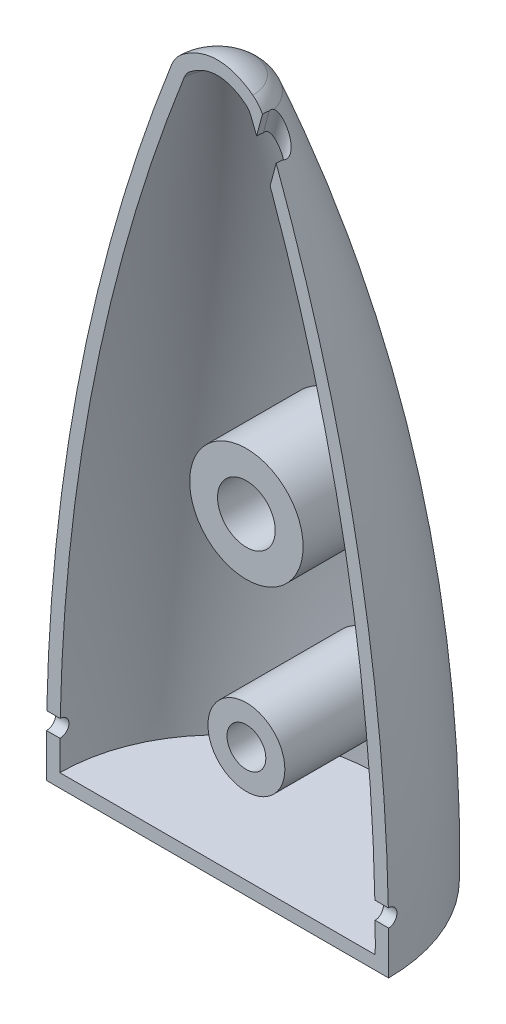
ISO-10303-21;
HEADER;
FILE_DESCRIPTION(('STEP AP214'),'2;1');
FILE_NAME('part.step','',(''),(''),'','','');
FILE_SCHEMA(('AUTOMOTIVE_DESIGN { 1 0 10303 214 1 1 1 1 }'));
ENDSEC;
DATA;
#1=APPLICATION_CONTEXT('core data for automotive mechanical design processes');
#2=APPLICATION_PROTOCOL_DEFINITION('international standard','automotive_design',2000,#1);
#3=PRODUCT_CONTEXT('',#1,'mechanical');
#4=PRODUCT('Part','Part','',(#3));
#5=PRODUCT_RELATED_PRODUCT_CATEGORY('part','',(#4));
#6=PRODUCT_DEFINITION_FORMATION('','',#4);
#7=PRODUCT_DEFINITION_CONTEXT('part definition',#1,'design');
#8=PRODUCT_DEFINITION('design','',#6,#7);
#9=PRODUCT_DEFINITION_SHAPE('','',#8);
#10=(LENGTH_UNIT() NAMED_UNIT(*) SI_UNIT(.MILLI.,.METRE.));
#11=(NAMED_UNIT(*) PLANE_ANGLE_UNIT() SI_UNIT($,.RADIAN.));
#12=(NAMED_UNIT(*) SI_UNIT($,.STERADIAN.) SOLID_ANGLE_UNIT());
#13=UNCERTAINTY_MEASURE_WITH_UNIT(LENGTH_MEASURE(1.E-05),#10,'distance_accuracy_value','');
#14=(GEOMETRIC_REPRESENTATION_CONTEXT(3) GLOBAL_UNCERTAINTY_ASSIGNED_CONTEXT((#13)) GLOBAL_UNIT_ASSIGNED_CONTEXT((#10,
#11,#12)) REPRESENTATION_CONTEXT('',''));
#15=CARTESIAN_POINT('',(0.,0.,0.));
#16=DIRECTION('',(0.,0.,1.));
#17=DIRECTION('',(1.,0.,0.));
#18=AXIS2_PLACEMENT_3D('',#15,#16,#17);
#19=CARTESIAN_POINT('',(0.,0.,0.));
#20=DIRECTION('',(0.,0.,1.));
#21=DIRECTION('',(1.,0.,0.));
#22=AXIS2_PLACEMENT_3D('',#19,#20,#21);
#23=PLANE('',#22);
#24=CARTESIAN_POINT('',(-84.7224521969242,0.491285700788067,0.));
#25=DIRECTION('',(0.,0.,1.));
#26=DIRECTION('',(1.,0.,0.));
#27=AXIS2_PLACEMENT_3D('',#24,#25,#26);
#28=CIRCLE('',#27,92.9237509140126);
#29=CARTESIAN_POINT('',(2.03051903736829,33.7891154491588,0.));
#30=VERTEX_POINT('',#29);
#31=CARTESIAN_POINT('',(1.73909731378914,34.5386635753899,0.));
#32=VERTEX_POINT('',#31);
#33=EDGE_CURVE('E356',#30,#32,#28,.T.);
#34=ORIENTED_EDGE('',*,*,#33,.F.);
#35=DIRECTION('',(0.258819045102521,0.965925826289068,0.));
#36=VECTOR('',#35,1.);
#37=CARTESIAN_POINT('',(-6.55277880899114,1.75581179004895,0.));
#38=LINE('',#37,#36);
#39=CARTESIAN_POINT('',(2.33418369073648,34.9224073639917,0.));
#40=VERTEX_POINT('',#39);
#41=EDGE_CURVE('E155',#30,#40,#38,.T.);
#42=ORIENTED_EDGE('',*,*,#41,.T.);
#43=CARTESIAN_POINT('',(0.808640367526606,34.172262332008,0.));
#44=DIRECTION('',(0.,0.,1.));
#45=DIRECTION('',(1.,0.,0.));
#46=AXIS2_PLACEMENT_3D('',#43,#44,#45);
#47=CIRCLE('',#46,1.7);
#48=CARTESIAN_POINT('',(1.83457929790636,35.5277878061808,0.));
#49=VERTEX_POINT('',#48);
#50=EDGE_CURVE('E291',#40,#49,#47,.T.);
#51=ORIENTED_EDGE('',*,*,#50,.T.);
#52=CARTESIAN_POINT('',(0.,36.2,0.));
#53=CARTESIAN_POINT('',(3.33332879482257E-05,36.200000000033,0.));
#54=CARTESIAN_POINT('',(6.66666212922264E-05,36.1999999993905,0.));
#55=CARTESIAN_POINT('',(0.323802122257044,36.1999871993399,0.));
#56=CARTESIAN_POINT('',(0.651782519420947,36.1362750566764,0.));
#57=CARTESIAN_POINT('',(0.956533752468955,36.021827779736,0.));
#58=CARTESIAN_POINT('',(0.958227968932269,36.0211896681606,0.));
#59=CARTESIAN_POINT('',(0.966696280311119,36.017991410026,0.));
#60=CARTESIAN_POINT('',(0.973461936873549,36.0154082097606,0.));
#61=CARTESIAN_POINT('',(1.00724610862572,36.0023689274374,0.));
#62=CARTESIAN_POINT('',(1.0341244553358,35.9915459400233,0.));
#63=CARTESIAN_POINT('',(1.16786310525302,35.935484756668,0.));
#64=CARTESIAN_POINT('',(1.27231283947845,35.8845773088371,0.));
#65=CARTESIAN_POINT('',(1.75977655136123,35.6158578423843,0.));
#66=CARTESIAN_POINT('',(2.10712774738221,35.3285775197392,0.));
#67=CARTESIAN_POINT('',(2.4107762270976,35.0126686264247,0.));
#68=B_SPLINE_CURVE_WITH_KNOTS('',3,(#52,#53,#54,#55,#56,#57,#58,#59,#60,#61,#62,#63,#64,#65,#66,
#67),.UNSPECIFIED.,.F.,.F.,(4,2,2,2,2,2,2,4),(0.,0.00010000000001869,0.971205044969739,
0.976636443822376,0.998362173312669,1.08527345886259,1.43340025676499,2.75258320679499),.UNSPECIFIED.);
#69=CARTESIAN_POINT('',(0.,36.2,0.));
#70=VERTEX_POINT('',#69);
#71=EDGE_CURVE('E293',#49,#70,#68,.F.);
#72=ORIENTED_EDGE('',*,*,#71,.T.);
#73=CARTESIAN_POINT('',(0.,36.2,0.));
#74=CARTESIAN_POINT('',(-3.33332879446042E-05,36.200000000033,0.));
#75=CARTESIAN_POINT('',(-6.66666212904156E-05,36.1999999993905,0.));
#76=CARTESIAN_POINT('',(-0.323802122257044,36.1999871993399,0.));
#77=CARTESIAN_POINT('',(-0.651782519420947,36.1362750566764,0.));
#78=CARTESIAN_POINT('',(-0.956533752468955,36.021827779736,0.));
#79=CARTESIAN_POINT('',(-0.958227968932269,36.0211896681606,0.));
#80=CARTESIAN_POINT('',(-0.966696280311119,36.017991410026,0.));
#81=CARTESIAN_POINT('',(-0.973461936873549,36.0154082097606,0.));
#82=CARTESIAN_POINT('',(-1.00724610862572,36.0023689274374,0.));
#83=CARTESIAN_POINT('',(-1.0341244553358,35.9915459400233,0.));
#84=CARTESIAN_POINT('',(-1.16786310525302,35.935484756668,0.));
#85=CARTESIAN_POINT('',(-1.27231283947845,35.8845773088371,0.));
#86=CARTESIAN_POINT('',(-1.75977655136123,35.6158578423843,0.));
#87=CARTESIAN_POINT('',(-2.10712774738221,35.3285775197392,0.));
#88=CARTESIAN_POINT('',(-2.4107762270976,35.0126686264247,0.));
#89=B_SPLINE_CURVE_WITH_KNOTS('',3,(#73,#74,#75,#76,#77,#78,#79,#80,#81,#82,#83,#84,#85,#86,#87,
#88),.UNSPECIFIED.,.F.,.F.,(4,2,2,2,2,2,2,4),(0.,0.000100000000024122,0.971205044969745,
0.976636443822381,0.998362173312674,1.0852734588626,1.43340025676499,2.75258320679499),.UNSPECIFIED.);
#90=CARTESIAN_POINT('',(-1.83457929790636,35.5277878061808,0.));
#91=VERTEX_POINT('',#90);
#92=EDGE_CURVE('E280',#91,#70,#89,.F.);
#93=ORIENTED_EDGE('',*,*,#92,.F.);
#94=CARTESIAN_POINT('',(-0.808640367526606,34.172262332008,0.));
#95=DIRECTION('',(0.,0.,1.));
#96=DIRECTION('',(1.,0.,0.));
#97=AXIS2_PLACEMENT_3D('',#94,#95,#96);
#98=CIRCLE('',#97,1.7);
#99=CARTESIAN_POINT('',(-2.39041717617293,34.7951444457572,0.));
#100=VERTEX_POINT('',#99);
#101=EDGE_CURVE('E277',#100,#91,#98,.F.);
#102=ORIENTED_EDGE('',*,*,#101,.F.);
#103=CARTESIAN_POINT('',(84.7224521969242,0.491285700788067,-5.91614064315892E-13));
#104=DIRECTION('',(0.,0.,1.));
#105=DIRECTION('',(1.,0.,0.));
#106=AXIS2_PLACEMENT_3D('',#103,#104,#105);
#107=CIRCLE('',#106,93.6237509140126);
#108=CARTESIAN_POINT('',(-8.88080722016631,2.45,-5.91614064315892E-13));
#109=VERTEX_POINT('',#108);
#110=EDGE_CURVE('E284',#109,#100,#107,.F.);
#111=ORIENTED_EDGE('',*,*,#110,.F.);
#112=DIRECTION('',(1.,0.,0.));
#113=VECTOR('',#112,1.);
#114=CARTESIAN_POINT('',(-16.5,2.45,1.1521895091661E-13));
#115=LINE('',#114,#113);
#116=CARTESIAN_POINT('',(-8.18065282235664,2.45,-5.91616019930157E-13));
#117=VERTEX_POINT('',#116);
#118=EDGE_CURVE('E173',#117,#109,#115,.F.);
#119=ORIENTED_EDGE('',*,*,#118,.F.);
#120=CARTESIAN_POINT('',(84.7224521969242,0.491285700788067,-5.91614064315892E-13));
#121=DIRECTION('',(0.,0.,-1.));
#122=DIRECTION('',(-1.,0.,0.));
#123=AXIS2_PLACEMENT_3D('',#120,#121,#122);
#124=CIRCLE('',#123,92.9237509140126);
#125=CARTESIAN_POINT('',(-1.73909731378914,34.5386635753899,0.));
#126=VERTEX_POINT('',#125);
#127=EDGE_CURVE('E417',#117,#126,#124,.T.);
#128=ORIENTED_EDGE('',*,*,#127,.T.);
#129=CARTESIAN_POINT('',(-0.808640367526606,34.172262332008,0.));
#130=DIRECTION('',(0.,0.,-1.));
#131=DIRECTION('',(-1.,0.,0.));
#132=AXIS2_PLACEMENT_3D('',#129,#130,#131);
#133=CIRCLE('',#132,1.);
#134=CARTESIAN_POINT('',(-1.41213385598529,34.969630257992,0.));
#135=VERTEX_POINT('',#134);
#136=EDGE_CURVE('E353',#126,#135,#133,.T.);
#137=ORIENTED_EDGE('',*,*,#136,.T.);
#138=CARTESIAN_POINT('',(0.,0.,0.));
#139=DIRECTION('',(0.,0.,-1.));
#140=DIRECTION('',(0.,1.,0.));
#141=AXIS2_PLACEMENT_3D('',#138,#139,#140);
#142=ELLIPSE('',#141,35.5,8.2);
#143=CARTESIAN_POINT('',(0.,35.5,0.));
#144=VERTEX_POINT('',#143);
#145=EDGE_CURVE('E358',#135,#144,#142,.T.);
#146=ORIENTED_EDGE('',*,*,#145,.T.);
#147=CARTESIAN_POINT('',(0.,0.,0.));
#148=DIRECTION('',(0.,0.,1.));
#149=DIRECTION('',(0.,1.,0.));
#150=AXIS2_PLACEMENT_3D('',#147,#148,#149);
#151=ELLIPSE('',#150,35.5,8.2);
#152=CARTESIAN_POINT('',(1.41213385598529,34.969630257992,0.));
#153=VERTEX_POINT('',#152);
#154=EDGE_CURVE('E361',#153,#144,#151,.T.);
#155=ORIENTED_EDGE('',*,*,#154,.F.);
#156=CARTESIAN_POINT('',(0.808640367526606,34.172262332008,0.));
#157=DIRECTION('',(0.,0.,1.));
#158=DIRECTION('',(1.,0.,0.));
#159=AXIS2_PLACEMENT_3D('',#156,#157,#158);
#160=CIRCLE('',#159,1.);
#161=EDGE_CURVE('E364',#32,#153,#160,.T.);
#162=ORIENTED_EDGE('',*,*,#161,.F.);
#163=EDGE_LOOP('',(#34,#42,#51,#72,#93,#102,#111,#119,#128,#137,#146,#155,#162));
#164=FACE_BOUND('',#163,.T.);
#165=ADVANCED_FACE('F38',(#164),#23,.T.);
#166=CARTESIAN_POINT('',(-84.7224521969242,0.491285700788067,5.91614064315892E-13));
#167=DIRECTION('',(0.,0.,1.));
#168=DIRECTION('',(1.,0.,0.));
#169=AXIS2_PLACEMENT_3D('',#166,#167,#168);
#170=CIRCLE('',#169,93.6237509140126);
#171=CARTESIAN_POINT('',(8.88080722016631,2.45,5.91614064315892E-13));
#172=VERTEX_POINT('',#171);
#173=CARTESIAN_POINT('',(3.04922030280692,33.0725723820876,0.));
#174=VERTEX_POINT('',#173);
#175=EDGE_CURVE('E290',#172,#174,#170,.T.);
#176=ORIENTED_EDGE('',*,*,#175,.T.);
#177=DIRECTION('',(-0.258819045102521,-0.965925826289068,0.));
#178=VECTOR('',#177,1.);
#179=CARTESIAN_POINT('',(-5.42318182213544,1.45313718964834,0.));
#180=LINE('',#179,#178);
#181=CARTESIAN_POINT('',(2.73382089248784,31.8954857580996,0.));
#182=VERTEX_POINT('',#181);
#183=EDGE_CURVE('E150',#174,#182,#180,.T.);
#184=ORIENTED_EDGE('',*,*,#183,.T.);
#185=CARTESIAN_POINT('',(8.18065282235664,2.45,0.));
#186=VERTEX_POINT('',#185);
#187=EDGE_CURVE('E354',#186,#182,#28,.T.);
#188=ORIENTED_EDGE('',*,*,#187,.F.);
#189=EDGE_CURVE('E349',#172,#186,#115,.F.);
#190=ORIENTED_EDGE('',*,*,#189,.F.);
#191=EDGE_LOOP('',(#176,#184,#188,#190));
#192=FACE_BOUND('',#191,.T.);
#193=ADVANCED_FACE('F312',(#192),#23,.T.);
#194=CARTESIAN_POINT('',(0.,34.172262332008,0.));
#195=DIRECTION('',(0.,-1.,0.));
#196=DIRECTION('',(0.,0.,-1.));
#197=AXIS2_PLACEMENT_3D('',#194,#195,#196);
#198=DEGENERATE_TOROIDAL_SURFACE('',#197,0.808640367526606,1.7,.T.);
#199=CARTESIAN_POINT('',(2.3341836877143,34.9224073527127,0.000200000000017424));
#200=CARTESIAN_POINT('',(2.3341831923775,34.9224055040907,-0.0607014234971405));
#201=CARTESIAN_POINT('',(2.33334700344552,34.9192848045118,-0.121581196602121));
#202=CARTESIAN_POINT('',(2.3308275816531,34.9098821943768,-0.212324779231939));
#203=CARTESIAN_POINT('',(2.32977781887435,34.9059644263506,-0.242460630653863));
#204=CARTESIAN_POINT('',(2.3272514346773,34.8965358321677,-0.302553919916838));
#205=CARTESIAN_POINT('',(2.32577357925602,34.8910204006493,-0.332510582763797));
#206=CARTESIAN_POINT('',(2.32408184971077,34.8847067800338,-0.362290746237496));
#207=B_SPLINE_CURVE_WITH_KNOTS('',3,(#199,#200,#201,#202,#203,#204,#205,#206),.UNSPECIFIED.,.F.,
.F.,(4,2,2,4),(0.,0.182557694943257,0.273738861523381,0.3651855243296),.UNSPECIFIED.);
#208=CARTESIAN_POINT('',(2.32409321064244,34.884749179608,-0.362090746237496));
#209=VERTEX_POINT('',#208);
#210=EDGE_CURVE('E171',#40,#209,#207,.T.);
#211=ORIENTED_EDGE('',*,*,#210,.T.);
#212=CARTESIAN_POINT('',(2.33548062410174,34.8751985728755,-0.314069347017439));
#213=CARTESIAN_POINT('',(2.33343429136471,34.8773767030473,-0.32186355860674));
#214=CARTESIAN_POINT('',(2.33146132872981,34.8792652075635,-0.329753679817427));
#215=CARTESIAN_POINT('',(2.3276742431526,34.8824477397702,-0.345705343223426));
#216=CARTESIAN_POINT('',(2.32586040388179,34.8837407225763,-0.353767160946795));
#217=CARTESIAN_POINT('',(2.31986859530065,34.8871600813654,-0.381988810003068));
#218=CARTESIAN_POINT('',(2.31614689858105,34.8877055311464,-0.402464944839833));
#219=CARTESIAN_POINT('',(2.30993656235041,34.8850132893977,-0.443362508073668));
#220=CARTESIAN_POINT('',(2.3074498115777,34.88176982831,-0.463783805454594));
#221=CARTESIAN_POINT('',(2.30367747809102,34.871857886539,-0.503736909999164));
#222=CARTESIAN_POINT('',(2.30238445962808,34.8652110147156,-0.523273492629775));
#223=CARTESIAN_POINT('',(2.30080134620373,34.8489994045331,-0.561111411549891));
#224=CARTESIAN_POINT('',(2.30051079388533,34.8394359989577,-0.579413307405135));
#225=CARTESIAN_POINT('',(2.30065061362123,34.82356643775,-0.605323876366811));
#226=CARTESIAN_POINT('',(2.3007832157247,34.8181758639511,-0.613514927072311));
#227=CARTESIAN_POINT('',(2.30119757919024,34.80691162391,-0.62954386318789));
#228=CARTESIAN_POINT('',(2.30147921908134,34.8010383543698,-0.637382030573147));
#229=CARTESIAN_POINT('',(2.30313701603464,34.7716219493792,-0.674373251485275));
#230=CARTESIAN_POINT('',(2.30535643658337,34.7450676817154,-0.701137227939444));
#231=CARTESIAN_POINT('',(2.31038036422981,34.687798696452,-0.749704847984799));
#232=CARTESIAN_POINT('',(2.31318727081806,34.6570671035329,-0.771487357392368));
#233=CARTESIAN_POINT('',(2.31684781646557,34.6131209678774,-0.798343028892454));
#234=CARTESIAN_POINT('',(2.31781970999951,34.6010445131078,-0.805309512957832));
#235=CARTESIAN_POINT('',(2.318750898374,34.5888229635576,-0.811991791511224));
#236=B_SPLINE_CURVE_WITH_KNOTS('',3,(#212,#213,#214,#215,#216,#217,#218,#219,#220,#221,#222,
#223,#224,#225,#226,#227,#228,#229,#230,#231,#232,#233,#234,#235),.UNSPECIFIED.,.F.,.F.,(4,2,2,
2,2,2,2,2,2,2,2,4),(0.,0.0250282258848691,0.0501001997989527,0.112129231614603,
0.174252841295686,0.235986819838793,0.297692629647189,0.327096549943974,0.356476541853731,
0.468919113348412,0.581830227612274,0.623732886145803),.UNSPECIFIED.);
#237=CARTESIAN_POINT('',(2.30181138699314,34.7951444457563,-0.644793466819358));
#238=VERTEX_POINT('',#237);
#239=EDGE_CURVE('E170',#209,#238,#236,.T.);
#240=ORIENTED_EDGE('',*,*,#239,.T.);
#241=CARTESIAN_POINT('',(0.,34.7951444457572,0.));
#242=DIRECTION('',(0.,-1.,0.));
#243=DIRECTION('',(0.,0.,-1.));
#244=AXIS2_PLACEMENT_3D('',#241,#242,#243);
#245=CIRCLE('',#244,2.39041717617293);
#246=EDGE_CURVE('E169',#100,#238,#245,.T.);
#247=ORIENTED_EDGE('',*,*,#246,.F.);
#248=ORIENTED_EDGE('',*,*,#101,.T.);
#249=CARTESIAN_POINT('',(0.,35.5277878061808,0.));
#250=DIRECTION('',(0.,-1.,0.));
#251=DIRECTION('',(0.,0.,-1.));
#252=AXIS2_PLACEMENT_3D('',#249,#250,#251);
#253=CIRCLE('',#252,1.83457929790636);
#254=EDGE_CURVE('E268',#91,#49,#253,.T.);
#255=ORIENTED_EDGE('',*,*,#254,.T.);
#256=ORIENTED_EDGE('',*,*,#50,.F.);
#257=EDGE_LOOP('',(#211,#240,#247,#248,#255,#256));
#258=FACE_BOUND('',#257,.T.);
#259=ADVANCED_FACE('F308',(#258),#198,.T.);
#260=CARTESIAN_POINT('',(0.,0.491285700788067,0.));
#261=DIRECTION('',(0.,-1.,0.));
#262=DIRECTION('',(0.,0.,-1.));
#263=AXIS2_PLACEMENT_3D('',#260,#261,#262);
#264=DEGENERATE_TOROIDAL_SURFACE('',#263,84.7224521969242,93.6237509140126,.F.);
#265=ORIENTED_EDGE('',*,*,#246,.T.);
#266=CARTESIAN_POINT('',(2.30180016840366,34.7953444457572,-0.644541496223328));
#267=CARTESIAN_POINT('',(2.30271005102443,34.7792375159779,-0.664788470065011));
#268=CARTESIAN_POINT('',(2.30415534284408,34.761964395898,-0.683997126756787));
#269=CARTESIAN_POINT('',(2.3079517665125,34.7256943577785,-0.72048512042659));
#270=CARTESIAN_POINT('',(2.31029952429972,34.7067040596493,-0.737771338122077));
#271=CARTESIAN_POINT('',(2.31571625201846,34.6676879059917,-0.770534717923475));
#272=CARTESIAN_POINT('',(2.31877734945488,34.6476750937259,-0.786029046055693));
#273=CARTESIAN_POINT('',(2.32554465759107,34.6067077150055,-0.815609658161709));
#274=CARTESIAN_POINT('',(2.32925165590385,34.5857520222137,-0.829694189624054));
#275=CARTESIAN_POINT('',(2.33975012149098,34.5297451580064,-0.865035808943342));
#276=CARTESIAN_POINT('',(2.34701566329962,34.4941143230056,-0.885235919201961));
#277=CARTESIAN_POINT('',(2.36287567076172,34.421631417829,-0.922659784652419));
#278=CARTESIAN_POINT('',(2.37147037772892,34.3847791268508,-0.939882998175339));
#279=CARTESIAN_POINT('',(2.39923205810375,34.2723740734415,-0.987768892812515));
#280=CARTESIAN_POINT('',(2.42027553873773,34.195505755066,-1.01432928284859));
#281=CARTESIAN_POINT('',(2.46865607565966,34.0345846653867,-1.05886635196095));
#282=CARTESIAN_POINT('',(2.49634591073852,33.9504242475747,-1.07605332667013));
#283=CARTESIAN_POINT('',(2.55677398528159,33.7825407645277,-1.09769228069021));
#284=CARTESIAN_POINT('',(2.58948881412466,33.6988174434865,-1.10220153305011));
#285=CARTESIAN_POINT('',(2.64600171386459,33.5662575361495,-1.09705201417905));
#286=CARTESIAN_POINT('',(2.66828551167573,33.5165785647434,-1.09224308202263));
#287=CARTESIAN_POINT('',(2.71448234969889,33.41905682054,-1.0757892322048));
#288=CARTESIAN_POINT('',(2.73839482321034,33.3712134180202,-1.06414668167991));
#289=CARTESIAN_POINT('',(2.78128268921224,33.2903712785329,-1.03644952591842));
#290=CARTESIAN_POINT('',(2.80001388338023,33.2566309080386,-1.02220205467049));
#291=CARTESIAN_POINT('',(2.83768635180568,33.1921595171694,-0.988188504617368));
#292=CARTESIAN_POINT('',(2.85662716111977,33.1614229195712,-0.968432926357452));
#293=CARTESIAN_POINT('',(2.88845390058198,33.112936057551,-0.929385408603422));
#294=CARTESIAN_POINT('',(2.9014840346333,33.0940233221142,-0.911662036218));
#295=CARTESIAN_POINT('',(2.92682025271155,33.0593073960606,-0.872936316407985));
#296=CARTESIAN_POINT('',(2.9391272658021,33.0435001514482,-0.851938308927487));
#297=CARTESIAN_POINT('',(2.96049728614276,33.0182146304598,-0.810542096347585));
#298=CARTESIAN_POINT('',(2.9697593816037,33.0081209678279,-0.790625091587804));
#299=CARTESIAN_POINT('',(2.98698637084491,32.9912729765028,-0.748898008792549));
#300=CARTESIAN_POINT('',(2.99495200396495,32.984516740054,-0.727089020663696));
#301=CARTESIAN_POINT('',(3.00924920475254,32.9747238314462,-0.682029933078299));
#302=CARTESIAN_POINT('',(3.01557405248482,32.9717022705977,-0.658774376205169));
#303=CARTESIAN_POINT('',(3.02628782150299,32.9695727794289,-0.611649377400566));
#304=CARTESIAN_POINT('',(3.03067690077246,32.9704645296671,-0.58777998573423));
#305=CARTESIAN_POINT('',(3.03722858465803,32.9758136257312,-0.54171023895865));
#306=CARTESIAN_POINT('',(3.0395140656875,32.980042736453,-0.519499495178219));
#307=CARTESIAN_POINT('',(3.04239407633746,32.9914610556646,-0.475733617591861));
#308=CARTESIAN_POINT('',(3.04298763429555,32.9986519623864,-0.454178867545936));
#309=CARTESIAN_POINT('',(3.04271511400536,33.0120566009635,-0.420869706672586));
#310=CARTESIAN_POINT('',(3.0423527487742,33.017436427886,-0.408762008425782));
#311=CARTESIAN_POINT('',(3.04114671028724,33.0289614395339,-0.384994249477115));
#312=CARTESIAN_POINT('',(3.04030477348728,33.0351038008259,-0.373332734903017));
#313=CARTESIAN_POINT('',(3.03924267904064,33.0415964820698,-0.361890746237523));
#314=B_SPLINE_CURVE_WITH_KNOTS('',3,(#266,#267,#268,#269,#270,#271,#272,#273,#274,#275,#276,
#277,#278,#279,#280,#281,#282,#283,#284,#285,#286,#287,#288,#289,#290,#291,#292,#293,#294,#295,
#296,#297,#298,#299,#300,#301,#302,#303,#304,#305,#306,#307,#308,#309,#310,#311,#312,#313),
.UNSPECIFIED.,.F.,.F.,(4,2,2,2,2,2,2,2,2,2,2,2,2,2,2,2,2,2,2,2,2,2,2,4),(0.,0.0775147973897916,
0.154742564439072,0.231155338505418,0.30766195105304,0.432262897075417,0.5568864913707,
0.808000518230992,1.07787860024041,1.34653550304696,1.51015965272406,1.6737271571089,
1.7967800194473,1.91959988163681,2.00634063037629,2.09296738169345,2.1651849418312,
2.23736117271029,2.30982849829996,2.38228990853,2.45018500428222,2.51811908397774,
2.55784720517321,2.59743238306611),.UNSPECIFIED.);
#315=CARTESIAN_POINT('',(3.03986591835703,33.0376613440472,-0.36893067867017));
#316=VERTEX_POINT('',#315);
#317=EDGE_CURVE('E160',#238,#316,#314,.T.);
#318=ORIENTED_EDGE('',*,*,#317,.T.);
#319=CARTESIAN_POINT('',(3.03985577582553,33.0376234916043,-0.36913067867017));
#320=CARTESIAN_POINT('',(3.04150594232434,33.0437819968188,-0.336614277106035));
#321=CARTESIAN_POINT('',(3.04294511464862,33.0491530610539,-0.303936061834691));
#322=CARTESIAN_POINT('',(3.04538616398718,33.0582631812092,-0.238426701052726));
#323=CARTESIAN_POINT('',(3.04638920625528,33.0620065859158,-0.205596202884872));
#324=CARTESIAN_POINT('',(3.04795171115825,33.0678379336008,-0.139776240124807));
#325=CARTESIAN_POINT('',(3.04851116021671,33.0699258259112,-0.10678677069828));
#326=CARTESIAN_POINT('',(3.0491822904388,33.0724305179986,-0.0406509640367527));
#327=CARTESIAN_POINT('',(3.0492927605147,33.0728427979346,-0.00750444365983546));
#328=CARTESIAN_POINT('',(3.04917514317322,33.0724038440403,0.0256307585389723));
#329=B_SPLINE_CURVE_WITH_KNOTS('',3,(#319,#320,#321,#322,#323,#324,#325,#326,#327,#328),
.UNSPECIFIED.,.F.,.F.,(4,2,2,2,4),(0.,0.0993992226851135,0.198531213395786,0.29766623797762,
0.397068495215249),.UNSPECIFIED.);
#330=EDGE_CURVE('E147',#316,#174,#329,.T.);
#331=ORIENTED_EDGE('',*,*,#330,.T.);
#332=ORIENTED_EDGE('',*,*,#175,.F.);
#333=CARTESIAN_POINT('',(8.89531245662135,1.55000004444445,0.000200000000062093));
#334=CARTESIAN_POINT('',(8.89531725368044,1.54996717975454,-0.0250877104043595));
#335=CARTESIAN_POINT('',(8.8951820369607,1.55210782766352,-0.0503694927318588));
#336=CARTESIAN_POINT('',(8.8946618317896,1.56057650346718,-0.10019913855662));
#337=CARTESIAN_POINT('',(8.89427704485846,1.56690115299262,-0.124747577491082));
#338=CARTESIAN_POINT('',(8.89328765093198,1.58358226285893,-0.172441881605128));
#339=CARTESIAN_POINT('',(8.89268294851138,1.59394047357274,-0.195587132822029));
#340=CARTESIAN_POINT('',(8.89130907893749,1.6183841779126,-0.239806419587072));
#341=CARTESIAN_POINT('',(8.89053993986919,1.63246903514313,-0.260880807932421));
#342=CARTESIAN_POINT('',(8.88890310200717,1.66398753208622,-0.300391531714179));
#343=CARTESIAN_POINT('',(8.88803529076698,1.68142500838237,-0.318824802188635));
#344=CARTESIAN_POINT('',(8.88627568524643,1.71914723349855,-0.352506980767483));
#345=CARTESIAN_POINT('',(8.88538388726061,1.73943242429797,-0.367755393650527));
#346=CARTESIAN_POINT('',(8.88364819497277,1.78230016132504,-0.394648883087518));
#347=CARTESIAN_POINT('',(8.88280435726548,1.80488533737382,-0.406289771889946));
#348=CARTESIAN_POINT('',(8.88123029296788,1.85169226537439,-0.425612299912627));
#349=CARTESIAN_POINT('',(8.88050005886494,1.87591390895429,-0.433294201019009));
#350=CARTESIAN_POINT('',(8.87920302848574,1.92529618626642,-0.444477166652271));
#351=CARTESIAN_POINT('',(8.87863615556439,1.95045637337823,-0.44798019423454));
#352=CARTESIAN_POINT('',(8.87769527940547,2.00101180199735,-0.450710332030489));
#353=CARTESIAN_POINT('',(8.87732127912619,2.02640704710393,-0.44993737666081));
#354=CARTESIAN_POINT('',(8.87677427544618,2.07667773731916,-0.44413953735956));
#355=CARTESIAN_POINT('',(8.87660102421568,2.10155378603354,-0.439119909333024));
#356=CARTESIAN_POINT('',(8.87644044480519,2.15011137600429,-0.42497768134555));
#357=CARTESIAN_POINT('',(8.87645311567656,2.17379292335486,-0.415855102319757));
#358=CARTESIAN_POINT('',(8.87663072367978,2.21928260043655,-0.393769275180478));
#359=CARTESIAN_POINT('',(8.87679561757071,2.24109126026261,-0.380807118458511));
#360=CARTESIAN_POINT('',(8.87722936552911,2.28222375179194,-0.351409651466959));
#361=CARTESIAN_POINT('',(8.87749821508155,2.3015476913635,-0.334974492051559));
#362=CARTESIAN_POINT('',(8.87808350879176,2.33717431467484,-0.29908717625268));
#363=CARTESIAN_POINT('',(8.87839997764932,2.35347542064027,-0.279633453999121));
#364=CARTESIAN_POINT('',(8.87902264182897,2.38258641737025,-0.238259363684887));
#365=CARTESIAN_POINT('',(8.87932883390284,2.39539521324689,-0.21633822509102));
#366=CARTESIAN_POINT('',(8.87987936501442,2.41716323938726,-0.170635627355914));
#367=CARTESIAN_POINT('',(8.88012364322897,2.4261186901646,-0.146852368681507));
#368=CARTESIAN_POINT('',(8.88050919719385,2.43989208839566,-0.0981483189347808));
#369=CARTESIAN_POINT('',(8.8806506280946,2.44471627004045,-0.0732293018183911));
#370=CARTESIAN_POINT('',(8.8807821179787,2.44914978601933,-0.0320523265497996));
#371=CARTESIAN_POINT('',(8.88080842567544,2.45001421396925,-0.0159218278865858));
#372=CARTESIAN_POINT('',(8.8808072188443,2.44999995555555,0.000200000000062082));
#373=B_SPLINE_CURVE_WITH_KNOTS('',3,(#333,#334,#335,#336,#337,#338,#339,#340,#341,#342,#343,
#344,#345,#346,#347,#348,#349,#350,#351,#352,#353,#354,#355,#356,#357,#358,#359,#360,#361,#362,
#363,#364,#365,#366,#367,#368,#369,#370,#371,#372),.UNSPECIFIED.,.F.,.F.,(4,2,2,2,2,2,2,2,2,2,2,
2,2,2,2,2,2,2,2,4),(0.,0.0757614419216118,0.151461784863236,0.227195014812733,0.302915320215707,
0.37872279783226,0.454542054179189,0.530448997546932,0.606350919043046,0.682217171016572,
0.758084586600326,0.833858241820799,0.909631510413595,0.985383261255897,1.0611317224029,
1.13691961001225,1.21273123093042,1.28861704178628,1.36438813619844,1.41275212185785),.UNSPECIFIED.);
#374=CARTESIAN_POINT('',(8.89531245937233,1.55,5.91614064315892E-13));
#375=VERTEX_POINT('',#374);
#376=EDGE_CURVE('E348',#375,#172,#373,.T.);
#377=ORIENTED_EDGE('',*,*,#376,.F.);
#378=CARTESIAN_POINT('',(8.89371934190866,-0.700000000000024,0.));
#379=VERTEX_POINT('',#378);
#380=EDGE_CURVE('E281',#379,#375,#170,.T.);
#381=ORIENTED_EDGE('',*,*,#380,.F.);
#382=CARTESIAN_POINT('',(0.,-0.700000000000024,0.));
#383=DIRECTION('',(0.,-1.,0.));
#384=DIRECTION('',(0.,0.,-1.));
#385=AXIS2_PLACEMENT_3D('',#382,#383,#384);
#386=CIRCLE('',#385,8.89371934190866);
#387=CARTESIAN_POINT('',(-8.89371934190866,-0.700000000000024,0.));
#388=VERTEX_POINT('',#387);
#389=EDGE_CURVE('E265',#388,#379,#386,.T.);
#390=ORIENTED_EDGE('',*,*,#389,.F.);
#391=CARTESIAN_POINT('',(-8.89531245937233,1.55,-5.91614064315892E-13));
#392=VERTEX_POINT('',#391);
#393=EDGE_CURVE('E275',#388,#392,#107,.F.);
#394=ORIENTED_EDGE('',*,*,#393,.T.);
#395=CARTESIAN_POINT('',(-8.88080721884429,2.44999995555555,0.000200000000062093));
#396=CARTESIAN_POINT('',(-8.8808109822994,2.45003272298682,-0.0251106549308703));
#397=CARTESIAN_POINT('',(-8.88074445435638,2.44788830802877,-0.0504157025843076));
#398=CARTESIAN_POINT('',(-8.88049609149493,2.43940355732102,-0.100293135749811));
#399=CARTESIAN_POINT('',(-8.88031434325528,2.43306637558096,-0.124866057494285));
#400=CARTESIAN_POINT('',(-8.87986064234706,2.41635031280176,-0.172608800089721));
#401=CARTESIAN_POINT('',(-8.87958864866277,2.40596959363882,-0.195777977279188));
#402=CARTESIAN_POINT('',(-8.8790003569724,2.38147046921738,-0.240040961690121));
#403=CARTESIAN_POINT('',(-8.87868406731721,2.36735276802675,-0.261135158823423));
#404=CARTESIAN_POINT('',(-8.87806158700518,2.33577221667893,-0.300661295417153));
#405=CARTESIAN_POINT('',(-8.87775539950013,2.31830833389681,-0.319092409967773));
#406=CARTESIAN_POINT('',(-8.87721155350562,2.2805309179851,-0.352764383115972));
#407=CARTESIAN_POINT('',(-8.87697390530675,2.2602169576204,-0.368004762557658));
#408=CARTESIAN_POINT('',(-8.87662168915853,2.21732003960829,-0.394857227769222));
#409=CARTESIAN_POINT('',(-8.87650710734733,2.19473733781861,-0.406469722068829));
#410=CARTESIAN_POINT('',(-8.87644467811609,2.14794416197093,-0.425737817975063));
#411=CARTESIAN_POINT('',(-8.87649681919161,2.12373380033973,-0.43339369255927));
#412=CARTESIAN_POINT('',(-8.8767947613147,2.07438924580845,-0.444528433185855));
#413=CARTESIAN_POINT('',(-8.87704043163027,2.04925568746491,-0.448010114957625));
#414=CARTESIAN_POINT('',(-8.8777316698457,1.99876290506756,-0.450707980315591));
#415=CARTESIAN_POINT('',(-8.87817724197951,1.97340367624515,-0.449924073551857));
#416=CARTESIAN_POINT('',(-8.87925230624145,1.92318439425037,-0.444115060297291));
#417=CARTESIAN_POINT('',(-8.87988176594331,1.89832425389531,-0.439090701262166));
#418=CARTESIAN_POINT('',(-8.88128738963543,1.8498022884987,-0.42494619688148));
#419=CARTESIAN_POINT('',(-8.88206355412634,1.82614046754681,-0.415826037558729));
#420=CARTESIAN_POINT('',(-8.88370816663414,1.78065964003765,-0.393737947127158));
#421=CARTESIAN_POINT('',(-8.88457670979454,1.75884257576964,-0.380766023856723));
#422=CARTESIAN_POINT('',(-8.88633719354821,1.71769614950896,-0.35134619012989));
#423=CARTESIAN_POINT('',(-8.88722913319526,1.69836668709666,-0.334898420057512));
#424=CARTESIAN_POINT('',(-8.88896311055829,1.66272525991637,-0.298975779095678));
#425=CARTESIAN_POINT('',(-8.88980510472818,1.64641590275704,-0.279498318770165));
#426=CARTESIAN_POINT('',(-8.89136583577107,1.6172942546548,-0.238070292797));
#427=CARTESIAN_POINT('',(-8.89208453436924,1.60448304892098,-0.216118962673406));
#428=CARTESIAN_POINT('',(-8.89333491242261,1.58272888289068,-0.1703723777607));
#429=CARTESIAN_POINT('',(-8.89386658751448,1.5737860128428,-0.14657707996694));
#430=CARTESIAN_POINT('',(-8.89469354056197,1.5600406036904,-0.0978481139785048));
#431=CARTESIAN_POINT('',(-8.89498917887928,1.55523175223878,-0.0729162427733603));
#432=CARTESIAN_POINT('',(-8.89526073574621,1.55083863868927,-0.0318346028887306));
#433=CARTESIAN_POINT('',(-8.89531409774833,1.54998588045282,-0.0158129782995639));
#434=CARTESIAN_POINT('',(-8.89531245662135,1.55000004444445,0.000200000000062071));
#435=B_SPLINE_CURVE_WITH_KNOTS('',3,(#395,#396,#397,#398,#399,#400,#401,#402,#403,#404,#405,
#406,#407,#408,#409,#410,#411,#412,#413,#414,#415,#416,#417,#418,#419,#420,#421,#422,#423,#424,
#425,#426,#427,#428,#429,#430,#431,#432,#433,#434),.UNSPECIFIED.,.F.,.F.,(4,2,2,2,2,2,2,2,2,2,2,
2,2,2,2,2,2,2,2,4),(0.,0.0758308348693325,0.151604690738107,0.227413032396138,0.303207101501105,
0.379024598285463,0.45485347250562,0.530673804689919,0.606488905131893,0.682252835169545,
0.758018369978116,0.833770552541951,0.909522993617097,0.985354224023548,1.06118239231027,
1.13707572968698,1.21299258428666,1.28891120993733,1.36471370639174,1.41275152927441),.UNSPECIFIED.);
#436=EDGE_CURVE('E337',#109,#392,#435,.T.);
#437=ORIENTED_EDGE('',*,*,#436,.F.);
#438=ORIENTED_EDGE('',*,*,#110,.T.);
#439=EDGE_LOOP('',(#265,#318,#331,#332,#377,#381,#390,#394,#437,#438));
#440=FACE_BOUND('',#439,.T.);
#441=ADVANCED_FACE('F167',(#440),#264,.F.);
#442=CARTESIAN_POINT('',(0.,0.491285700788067,0.));
#443=DIRECTION('',(0.,-1.,0.));
#444=DIRECTION('',(0.,0.,-1.));
#445=AXIS2_PLACEMENT_3D('',#442,#443,#444);
#446=DEGENERATE_TOROIDAL_SURFACE('',#445,84.7224521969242,92.9237509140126,.F.);
#447=CARTESIAN_POINT('',(-2.02544052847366,12.8552178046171,-7.09150859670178));
#448=CARTESIAN_POINT('',(-1.91076635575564,12.7469342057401,-7.13937610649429));
#449=CARTESIAN_POINT('',(-1.7868295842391,12.6473097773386,-7.18524936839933));
#450=CARTESIAN_POINT('',(-1.52258541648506,12.4682483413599,-7.26980881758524));
#451=CARTESIAN_POINT('',(-1.38224770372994,12.3888496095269,-7.30848134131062));
#452=CARTESIAN_POINT('',(-1.08781307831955,12.2530910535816,-7.37568459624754));
#453=CARTESIAN_POINT('',(-0.933667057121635,12.1968177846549,-7.40417717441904));
#454=CARTESIAN_POINT('',(-0.6165270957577,12.1104765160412,-7.44825007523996));
#455=CARTESIAN_POINT('',(-0.453542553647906,12.080381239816,-7.46384383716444));
#456=CARTESIAN_POINT('',(-0.136135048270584,12.0491482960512,-7.48003968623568));
#457=CARTESIAN_POINT('',(0.0180462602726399,12.0460601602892,-7.48165148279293));
#458=CARTESIAN_POINT('',(0.324624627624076,12.0638993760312,-7.47238684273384));
#459=CARTESIAN_POINT('',(0.477021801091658,12.0848251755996,-7.4615112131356));
#460=CARTESIAN_POINT('',(0.76984650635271,12.1484295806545,-7.42883532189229));
#461=CARTESIAN_POINT('',(0.910508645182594,12.1902606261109,-7.4074612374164));
#462=CARTESIAN_POINT('',(1.18262466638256,12.2935094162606,-7.35558941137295));
#463=CARTESIAN_POINT('',(1.31407682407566,12.3549308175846,-7.32508996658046));
#464=CARTESIAN_POINT('',(1.57291103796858,12.4996459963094,-7.25488126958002));
#465=CARTESIAN_POINT('',(1.699546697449,12.5840518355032,-7.21472126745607));
#466=CARTESIAN_POINT('',(1.93732334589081,12.7701784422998,-7.12903721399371));
#467=CARTESIAN_POINT('',(2.04845707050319,12.871907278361,-7.08351066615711));
#468=CARTESIAN_POINT('',(2.26427800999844,13.1018585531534,-6.98492215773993));
#469=CARTESIAN_POINT('',(2.36706904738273,13.2317402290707,-6.93157050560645));
#470=CARTESIAN_POINT('',(2.54968202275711,13.5070393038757,-6.82539687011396));
#471=CARTESIAN_POINT('',(2.62949129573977,13.6524652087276,-6.77257519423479));
#472=CARTESIAN_POINT('',(2.76754775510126,13.963831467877,-6.66862521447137));
#473=CARTESIAN_POINT('',(2.82446493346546,14.130444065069,-6.61772610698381));
#474=CARTESIAN_POINT('',(2.90799432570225,14.4735219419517,-6.52504715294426));
#475=CARTESIAN_POINT('',(2.93462660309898,14.649980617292,-6.48326128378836));
#476=CARTESIAN_POINT('',(2.95474086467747,14.9957785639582,-6.41470961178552));
#477=CARTESIAN_POINT('',(2.95026024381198,15.1648376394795,-6.38714561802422));
#478=CARTESIAN_POINT('',(2.91202421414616,15.5012111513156,-6.34483757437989));
#479=CARTESIAN_POINT('',(2.87828734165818,15.6685266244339,-6.33008541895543));
#480=CARTESIAN_POINT('',(2.78655875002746,15.9806386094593,-6.31390557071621));
#481=CARTESIAN_POINT('',(2.73101732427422,16.1261080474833,-6.3114002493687));
#482=CARTESIAN_POINT('',(2.59780879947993,16.4064029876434,-6.31520730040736));
#483=CARTESIAN_POINT('',(2.52013892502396,16.5412271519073,-6.3215207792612));
#484=CARTESIAN_POINT('',(2.34426244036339,16.7975751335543,-6.34054014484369));
#485=CARTESIAN_POINT('',(2.24591620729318,16.9189994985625,-6.35329036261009));
#486=CARTESIAN_POINT('',(2.03156436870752,17.1446392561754,-6.38222630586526));
#487=CARTESIAN_POINT('',(1.91555398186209,17.2488499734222,-6.39841296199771));
#488=CARTESIAN_POINT('',(1.66147101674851,17.4431614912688,-6.43218445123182));
#489=CARTESIAN_POINT('',(1.52251156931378,17.5321008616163,-6.44979606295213));
#490=CARTESIAN_POINT('',(1.23146872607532,17.6857140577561,-6.48233705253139));
#491=CARTESIAN_POINT('',(1.079385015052,17.750387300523,-6.49726636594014));
#492=CARTESIAN_POINT('',(0.764799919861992,17.8539845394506,-6.52201678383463));
#493=CARTESIAN_POINT('',(0.60222041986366,17.8926830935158,-6.53179301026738));
#494=CARTESIAN_POINT('',(0.27261228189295,17.9420977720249,-6.54438569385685));
#495=CARTESIAN_POINT('',(0.105584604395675,17.9528198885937,-6.5472036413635));
#496=CARTESIAN_POINT('',(-0.222825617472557,17.9460172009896,-6.54544158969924));
#497=CARTESIAN_POINT('',(-0.384227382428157,17.9293289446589,-6.54108067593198));
#498=CARTESIAN_POINT('',(-0.701834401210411,17.869849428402,-6.52606755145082));
#499=CARTESIAN_POINT('',(-0.858039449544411,17.8270571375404,-6.5154150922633));
#500=CARTESIAN_POINT('',(-1.16116564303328,17.7166610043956,-6.4895019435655));
#501=CARTESIAN_POINT('',(-1.30807720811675,17.6490320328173,-6.47423658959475));
#502=CARTESIAN_POINT('',(-1.58875835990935,17.4908457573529,-6.44160035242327));
#503=CARTESIAN_POINT('',(-1.72252445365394,17.4002823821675,-6.42422891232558));
#504=CARTESIAN_POINT('',(-1.97743871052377,17.1953999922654,-6.38992359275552));
#505=CARTESIAN_POINT('',(-2.09807665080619,17.080439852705,-6.37301928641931));
#506=CARTESIAN_POINT('',(-2.31855092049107,16.8315162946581,-6.34389333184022));
#507=CARTESIAN_POINT('',(-2.41838949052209,16.6975549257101,-6.33167117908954));
#508=CARTESIAN_POINT('',(-2.59326912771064,16.4158485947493,-6.31555203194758));
#509=CARTESIAN_POINT('',(-2.66856932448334,16.2682703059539,-6.31156549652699));
#510=CARTESIAN_POINT('',(-2.79336666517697,15.9627059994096,-6.31437193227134));
#511=CARTESIAN_POINT('',(-2.84287741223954,15.8047255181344,-6.32115921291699));
#512=CARTESIAN_POINT('',(-2.9126526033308,15.4929500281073,-6.34604834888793));
#513=CARTESIAN_POINT('',(-2.93443865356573,15.3394388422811,-6.36347530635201));
#514=CARTESIAN_POINT('',(-2.95382918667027,15.0324507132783,-6.40867267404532));
#515=CARTESIAN_POINT('',(-2.95143390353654,14.8789737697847,-6.43644298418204));
#516=CARTESIAN_POINT('',(-2.92332363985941,14.575843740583,-6.50081846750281));
#517=CARTESIAN_POINT('',(-2.89756703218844,14.4261979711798,-6.53743932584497));
#518=CARTESIAN_POINT('',(-2.82408772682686,14.1341260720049,-6.61718843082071));
#519=CARTESIAN_POINT('',(-2.7763443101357,13.9917068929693,-6.66032278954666));
#520=CARTESIAN_POINT('',(-2.65519606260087,13.7042628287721,-6.75450892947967));
#521=CARTESIAN_POINT('',(-2.57985492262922,13.5601753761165,-6.80592398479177));
#522=CARTESIAN_POINT('',(-2.4069430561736,13.2867553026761,-6.90966994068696));
#523=CARTESIAN_POINT('',(-2.30941782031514,13.157393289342,-6.96199876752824));
#524=CARTESIAN_POINT('',(-2.14573045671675,12.9738064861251,-7.03961262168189));
#525=CARTESIAN_POINT('',(-2.08691650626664,12.913267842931,-7.06584717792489));
#526=CARTESIAN_POINT('',(-2.02544052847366,12.8552178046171,-7.09150859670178));
#527=B_SPLINE_CURVE_WITH_KNOTS('',3,(#447,#448,#449,#450,#451,#452,#453,#454,#455,#456,#457,
#458,#459,#460,#461,#462,#463,#464,#465,#466,#467,#468,#469,#470,#471,#472,#473,#474,#475,#476,
#477,#478,#479,#480,#481,#482,#483,#484,#485,#486,#487,#488,#489,#490,#491,#492,#493,#494,#495,
#496,#497,#498,#499,#500,#501,#502,#503,#504,#505,#506,#507,#508,#509,#510,#511,#512,#513,#514,
#515,#516,#517,#518,#519,#520,#521,#522,#523,#524,#525,#526),.UNSPECIFIED.,.T.,.F.,(4,2,2,2,2,2,
2,2,2,2,2,2,2,2,2,2,2,2,2,2,2,2,2,2,2,2,2,2,2,2,2,2,2,2,2,2,2,2,2,4),(0.,0.494228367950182,
0.98938519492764,1.48637880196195,1.98285393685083,2.44314821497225,2.90341274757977,
3.34636994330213,3.78940986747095,4.25967267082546,4.73015510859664,5.24994406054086,
5.77001891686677,6.31701524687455,6.86364898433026,7.37484086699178,7.88570910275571,
8.35069879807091,8.81574683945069,9.28404236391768,9.75246487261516,10.2479214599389,
10.7433899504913,11.2431049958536,11.7427130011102,12.2273546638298,12.7120154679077,
13.1971679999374,13.6824490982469,14.1825532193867,14.6826034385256,15.1771876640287,
15.6715107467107,16.1373338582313,16.6031524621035,17.069802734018,17.5368936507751,
18.0463931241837,18.5548570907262,18.8198092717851),.UNSPECIFIED.);
#528=CARTESIAN_POINT('',(-2.02544052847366,12.8552178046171,-7.09150859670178));
#529=VERTEX_POINT('',#528);
#530=EDGE_CURVE('E370',#529,#529,#527,.T.);
#531=ORIENTED_EDGE('',*,*,#530,.F.);
#532=EDGE_LOOP('',(#531));
#533=FACE_BOUND('',#532,.T.);
#534=CARTESIAN_POINT('',(-1.46618275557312,3.13973968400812,-8.03080547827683));
#535=CARTESIAN_POINT('',(-1.39014542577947,3.05778543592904,-8.04706202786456));
#536=CARTESIAN_POINT('',(-1.3071807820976,2.98216853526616,-8.06315870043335));
#537=CARTESIAN_POINT('',(-1.12953095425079,2.84569717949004,-8.09355031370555));
#538=CARTESIAN_POINT('',(-1.03483907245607,2.78485121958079,-8.10784421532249));
#539=CARTESIAN_POINT('',(-0.836150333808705,2.67969992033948,-8.13328623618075));
#540=CARTESIAN_POINT('',(-0.732144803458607,2.63541020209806,-8.14443138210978));
#541=CARTESIAN_POINT('',(-0.517841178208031,2.56491414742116,-8.16246162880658));
#542=CARTESIAN_POINT('',(-0.407544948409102,2.5387024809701,-8.16934798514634));
#543=CARTESIAN_POINT('',(-0.186368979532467,2.50563419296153,-8.17807353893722));
#544=CARTESIAN_POINT('',(-0.0755549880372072,2.49836603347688,-8.18002002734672));
#545=CARTESIAN_POINT('',(0.145721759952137,2.50224943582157,-8.17898656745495));
#546=CARTESIAN_POINT('',(0.256184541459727,2.51339965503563,-8.17600697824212));
#547=CARTESIAN_POINT('',(0.47170159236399,2.55338473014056,-8.16550470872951));
#548=CARTESIAN_POINT('',(0.576815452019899,2.58192035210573,-8.15805893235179));
#549=CARTESIAN_POINT('',(0.780735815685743,2.65549349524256,-8.13938316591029));
#550=CARTESIAN_POINT('',(0.879541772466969,2.70053244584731,-8.12815284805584));
#551=CARTESIAN_POINT('',(1.06997088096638,2.80670302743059,-8.10269728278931));
#552=CARTESIAN_POINT('',(1.16143768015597,2.86810302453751,-8.08842296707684));
#553=CARTESIAN_POINT('',(1.33293374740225,3.00489982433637,-8.0582879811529));
#554=CARTESIAN_POINT('',(1.41296089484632,3.08029921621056,-8.04242701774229));
#555=CARTESIAN_POINT('',(1.56175441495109,3.24555062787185,-8.01004404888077));
#556=CARTESIAN_POINT('',(1.6301205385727,3.33576238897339,-7.99351631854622));
#557=CARTESIAN_POINT('',(1.75077240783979,3.52658401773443,-7.96177779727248));
#558=CARTESIAN_POINT('',(1.80305756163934,3.62719426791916,-7.94656705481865));
#559=CARTESIAN_POINT('',(1.89014707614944,3.83649858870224,-7.91879793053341));
#560=CARTESIAN_POINT('',(1.92488924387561,3.94521987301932,-7.90624907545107));
#561=CARTESIAN_POINT('',(1.97542455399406,4.16733870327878,-7.88498446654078));
#562=CARTESIAN_POINT('',(1.99122134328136,4.28073534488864,-7.87626797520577));
#563=CARTESIAN_POINT('',(2.0030863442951,4.50592363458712,-7.86348872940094));
#564=CARTESIAN_POINT('',(1.99964406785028,4.61768319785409,-7.8593137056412));
#565=CARTESIAN_POINT('',(1.97418443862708,4.83913952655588,-7.8553248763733));
#566=CARTESIAN_POINT('',(1.95216870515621,4.94883647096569,-7.85551069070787));
#567=CARTESIAN_POINT('',(1.89070879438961,5.16125160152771,-7.85978165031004));
#568=CARTESIAN_POINT('',(1.85154642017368,5.26405284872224,-7.86380493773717));
#569=CARTESIAN_POINT('',(1.75700794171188,5.46173260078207,-7.87483238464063));
#570=CARTESIAN_POINT('',(1.70163045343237,5.55661042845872,-7.8818367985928));
#571=CARTESIAN_POINT('',(1.5753576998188,5.73715304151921,-7.89782023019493));
#572=CARTESIAN_POINT('',(1.50426223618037,5.82267548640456,-7.90682473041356));
#573=CARTESIAN_POINT('',(1.34894223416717,5.98075531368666,-7.92544606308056));
#574=CARTESIAN_POINT('',(1.26471630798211,6.05331132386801,-7.93506296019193));
#575=CARTESIAN_POINT('',(1.083827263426,6.18464275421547,-7.95376209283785));
#576=CARTESIAN_POINT('',(0.986975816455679,6.2431608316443,-7.96283234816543));
#577=CARTESIAN_POINT('',(0.784668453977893,6.34310137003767,-7.97902294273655));
#578=CARTESIAN_POINT('',(0.679212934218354,6.38452461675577,-7.98614337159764));
#579=CARTESIAN_POINT('',(0.463250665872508,6.44885213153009,-7.99745019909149));
#580=CARTESIAN_POINT('',(0.352773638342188,6.47185334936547,-8.00165194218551));
#581=CARTESIAN_POINT('',(0.129454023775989,6.49897231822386,-8.00662448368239));
#582=CARTESIAN_POINT('',(0.0166116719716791,6.50309193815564,-8.00739562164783));
#583=CARTESIAN_POINT('',(-0.2064800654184,6.49239960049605,-8.00542078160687));
#584=CARTESIAN_POINT('',(-0.316743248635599,6.47786333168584,-8.00272601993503));
#585=CARTESIAN_POINT('',(-0.533230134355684,6.43078672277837,-7.9942555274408));
#586=CARTESIAN_POINT('',(-0.639453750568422,6.39824599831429,-7.98847973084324));
#587=CARTESIAN_POINT('',(-0.845163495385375,6.31603881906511,-7.97457451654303));
#588=CARTESIAN_POINT('',(-0.944633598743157,6.26633322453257,-7.96643972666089));
#589=CARTESIAN_POINT('',(-1.13390810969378,6.15121916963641,-7.94887860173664));
#590=CARTESIAN_POINT('',(-1.22371144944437,6.08580897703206,-7.93945212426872));
#591=CARTESIAN_POINT('',(-1.39255677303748,5.93993777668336,-7.92041563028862));
#592=CARTESIAN_POINT('',(-1.47141321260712,5.85926192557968,-7.91080501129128));
#593=CARTESIAN_POINT('',(-1.61452934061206,5.68572502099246,-7.89292625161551));
#594=CARTESIAN_POINT('',(-1.67878890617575,5.59286386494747,-7.88465812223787));
#595=CARTESIAN_POINT('',(-1.79089515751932,5.39743573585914,-7.87076331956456));
#596=CARTESIAN_POINT('',(-1.83873076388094,5.29486227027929,-7.86513842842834));
#597=CARTESIAN_POINT('',(-1.9164625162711,5.08300689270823,-7.85759999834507));
#598=CARTESIAN_POINT('',(-1.94636184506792,4.97372617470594,-7.85568580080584));
#599=CARTESIAN_POINT('',(-1.98690754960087,4.75387031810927,-7.85620886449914));
#600=CARTESIAN_POINT('',(-1.99791836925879,4.64336209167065,-7.85856191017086));
#601=CARTESIAN_POINT('',(-2.00154409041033,4.42221254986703,-7.86757379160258));
#602=CARTESIAN_POINT('',(-1.99415770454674,4.31157122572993,-7.87423292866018));
#603=CARTESIAN_POINT('',(-1.96145561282,4.09418645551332,-7.89139481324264));
#604=CARTESIAN_POINT('',(-1.93628016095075,3.98741934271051,-7.90186718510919));
#605=CARTESIAN_POINT('',(-1.86900202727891,3.77976782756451,-7.92584270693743));
#606=CARTESIAN_POINT('',(-1.82690674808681,3.67888087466,-7.93934453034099));
#607=CARTESIAN_POINT('',(-1.73544736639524,3.50178867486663,-7.96581543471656));
#608=CARTESIAN_POINT('',(-1.68849037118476,3.42428340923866,-7.97849334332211));
#609=CARTESIAN_POINT('',(-1.58459259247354,3.27638453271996,-8.00441746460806));
#610=CARTESIAN_POINT('',(-1.52765120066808,3.20599135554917,-8.01766371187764));
#611=CARTESIAN_POINT('',(-1.46618275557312,3.13973968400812,-8.03080547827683));
#612=B_SPLINE_CURVE_WITH_KNOTS('',3,(#534,#535,#536,#537,#538,#539,#540,#541,#542,#543,#544,
#545,#546,#547,#548,#549,#550,#551,#552,#553,#554,#555,#556,#557,#558,#559,#560,#561,#562,#563,
#564,#565,#566,#567,#568,#569,#570,#571,#572,#573,#574,#575,#576,#577,#578,#579,#580,#581,#582,
#583,#584,#585,#586,#587,#588,#589,#590,#591,#592,#593,#594,#595,#596,#597,#598,#599,#600,#601,
#602,#603,#604,#605,#606,#607,#608,#609,#610,#611),.UNSPECIFIED.,.T.,.F.,(4,2,2,2,2,2,2,2,2,2,2,
2,2,2,2,2,2,2,2,2,2,2,2,2,2,2,2,2,2,2,2,2,2,2,2,2,2,2,4),(0.,0.3385940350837,0.677382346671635,
1.01648950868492,1.35549664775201,1.68707517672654,2.01862953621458,2.34463241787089,
2.67066354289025,3.00241228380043,3.33422244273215,3.67578802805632,4.01736618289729,
4.36014693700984,4.70286169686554,5.03689689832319,5.37090298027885,5.69961448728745,
6.02835405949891,6.36155039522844,6.69478197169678,7.03372161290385,7.37264567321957,
7.70977413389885,8.04686922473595,8.37903975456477,8.71121737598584,9.04415749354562,
9.37713435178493,9.71520263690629,10.0532737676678,10.3915725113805,10.729811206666,
11.0614471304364,11.3931062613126,11.7221792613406,12.0511084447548,12.324810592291,
12.5985294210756),.UNSPECIFIED.);
#613=CARTESIAN_POINT('',(-1.46618275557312,3.13973968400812,-8.03080547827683));
#614=VERTEX_POINT('',#613);
#615=EDGE_CURVE('E441',#614,#614,#612,.T.);
#616=ORIENTED_EDGE('',*,*,#615,.F.);
#617=EDGE_LOOP('',(#616));
#618=FACE_BOUND('',#617,.T.);
#619=CARTESIAN_POINT('',(2.03045248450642,33.7888670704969,0.0256403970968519));
#620=CARTESIAN_POINT('',(2.03062547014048,33.7895126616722,-0.00717381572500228));
#621=CARTESIAN_POINT('',(2.03046632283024,33.7889187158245,-0.0400106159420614));
#622=CARTESIAN_POINT('',(2.02950211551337,33.7853202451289,-0.105361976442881));
#623=CARTESIAN_POINT('',(2.02870060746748,33.782328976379,-0.137877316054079));
#624=CARTESIAN_POINT('',(2.02647171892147,33.7740106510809,-0.202578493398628));
#625=CARTESIAN_POINT('',(2.02504442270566,33.768683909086,-0.234764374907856));
#626=CARTESIAN_POINT('',(2.0215887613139,33.7557872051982,-0.298837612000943));
#627=CARTESIAN_POINT('',(2.0195571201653,33.7482050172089,-0.330722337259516));
#628=CARTESIAN_POINT('',(2.01724386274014,33.7395718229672,-0.3622907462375));
#629=B_SPLINE_CURVE_WITH_KNOTS('',3,(#619,#620,#621,#622,#623,#624,#625,#626,#627,#628),
.UNSPECIFIED.,.F.,.F.,(4,2,2,2,4),(0.,0.0984333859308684,0.196326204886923,0.294205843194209,
0.392626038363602),.UNSPECIFIED.);
#630=CARTESIAN_POINT('',(2.01725850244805,33.7396264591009,-0.362090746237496));
#631=VERTEX_POINT('',#630);
#632=EDGE_CURVE('E12',#30,#631,#629,.T.);
#633=ORIENTED_EDGE('',*,*,#632,.F.);
#634=ORIENTED_EDGE('',*,*,#33,.T.);
#635=CARTESIAN_POINT('',(0.,34.5386635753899,0.));
#636=DIRECTION('',(0.,-1.,0.));
#637=DIRECTION('',(0.,0.,-1.));
#638=AXIS2_PLACEMENT_3D('',#635,#636,#637);
#639=CIRCLE('',#638,1.73909731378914);
#640=EDGE_CURVE('E294',#126,#32,#639,.T.);
#641=ORIENTED_EDGE('',*,*,#640,.F.);
#642=ORIENTED_EDGE('',*,*,#127,.F.);
#643=CARTESIAN_POINT('',(-8.18065282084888,2.44999995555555,0.000200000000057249));
#644=CARTESIAN_POINT('',(-8.18065698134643,2.4500327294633,-0.0251090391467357));
#645=CARTESIAN_POINT('',(-8.18058124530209,2.44788858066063,-0.0504124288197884));
#646=CARTESIAN_POINT('',(-8.18029783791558,2.43940498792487,-0.100286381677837));
#647=CARTESIAN_POINT('',(-8.18009026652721,2.43306872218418,-0.124857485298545));
#648=CARTESIAN_POINT('',(-8.17957085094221,2.41635524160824,-0.172596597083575));
#649=CARTESIAN_POINT('',(-8.17925895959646,2.40597619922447,-0.195763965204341));
#650=CARTESIAN_POINT('',(-8.17858150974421,2.38148114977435,-0.240023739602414));
#651=CARTESIAN_POINT('',(-8.17821596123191,2.36736583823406,-0.261116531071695));
#652=CARTESIAN_POINT('',(-8.17749119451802,2.33578924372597,-0.300642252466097));
#653=CARTESIAN_POINT('',(-8.17713197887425,2.31832664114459,-0.31907412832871));
#654=CARTESIAN_POINT('',(-8.17648451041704,2.28055153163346,-0.352747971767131));
#655=CARTESIAN_POINT('',(-8.17619626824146,2.26023859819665,-0.367989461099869));
#656=CARTESIAN_POINT('',(-8.17575123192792,2.21734272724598,-0.394844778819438));
#657=CARTESIAN_POINT('',(-8.17559442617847,2.19475999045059,-0.406458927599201));
#658=CARTESIAN_POINT('',(-8.17546094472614,2.1479661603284,-0.425730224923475));
#659=CARTESIAN_POINT('',(-8.17548425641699,2.12375518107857,-0.43338765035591));
#660=CARTESIAN_POINT('',(-8.17574144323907,2.07441270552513,-0.44452435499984));
#661=CARTESIAN_POINT('',(-8.17597514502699,2.04928198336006,-0.44800706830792));
#662=CARTESIAN_POINT('',(-8.17666086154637,1.99879488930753,-0.450707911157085));
#663=CARTESIAN_POINT('',(-8.1771128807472,1.97343851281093,-0.449925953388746));
#664=CARTESIAN_POINT('',(-8.17821870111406,1.92322732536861,-0.444122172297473));
#665=CARTESIAN_POINT('',(-8.17887244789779,1.89837238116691,-0.439101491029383));
#666=CARTESIAN_POINT('',(-8.18034200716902,1.84986034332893,-0.424966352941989));
#667=CARTESIAN_POINT('',(-8.18115782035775,1.82620325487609,-0.415851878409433));
#668=CARTESIAN_POINT('',(-8.18289303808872,1.78072755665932,-0.393775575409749));
#669=CARTESIAN_POINT('',(-8.18381256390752,1.75891115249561,-0.380809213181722));
#670=CARTESIAN_POINT('',(-8.18568069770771,1.71776488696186,-0.351401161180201));
#671=CARTESIAN_POINT('',(-8.18662930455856,1.69843492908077,-0.334959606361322));
#672=CARTESIAN_POINT('',(-8.18847639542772,1.66278739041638,-0.299045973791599));
#673=CARTESIAN_POINT('',(-8.18937482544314,1.64647301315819,-0.279570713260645));
#674=CARTESIAN_POINT('',(-8.19104179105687,1.61734103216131,-0.238145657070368));
#675=CARTESIAN_POINT('',(-8.19181028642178,1.6045245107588,-0.216195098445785));
#676=CARTESIAN_POINT('',(-8.19314811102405,1.58276027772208,-0.170449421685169));
#677=CARTESIAN_POINT('',(-8.19371744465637,1.57381248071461,-0.146654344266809));
#678=CARTESIAN_POINT('',(-8.19460333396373,1.56005747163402,-0.0979243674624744));
#679=CARTESIAN_POINT('',(-8.19492027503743,1.55524394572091,-0.0729912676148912));
#680=CARTESIAN_POINT('',(-8.19521178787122,1.55084123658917,-0.0318837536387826));
#681=CARTESIAN_POINT('',(-8.19526914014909,1.54998583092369,-0.0158375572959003));
#682=CARTESIAN_POINT('',(-8.19526735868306,1.55000004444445,0.000200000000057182));
#683=B_SPLINE_CURVE_WITH_KNOTS('',3,(#643,#644,#645,#646,#647,#648,#649,#650,#651,#652,#653,
#654,#655,#656,#657,#658,#659,#660,#661,#662,#663,#664,#665,#666,#667,#668,#669,#670,#671,#672,
#673,#674,#675,#676,#677,#678,#679,#680,#681,#682),.UNSPECIFIED.,.F.,.F.,(4,2,2,2,2,2,2,2,2,2,2,
2,2,2,2,2,2,2,2,4),(0.,0.0758259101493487,0.151594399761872,0.227397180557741,0.303185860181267,
0.379004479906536,0.454834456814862,0.530657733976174,0.60647570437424,0.682231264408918,
0.757988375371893,0.833725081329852,0.909462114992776,0.985288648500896,1.06111223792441,
1.13701591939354,1.21294306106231,1.2888685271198,1.36467783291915,1.4127892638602),.UNSPECIFIED.);
#684=CARTESIAN_POINT('',(-8.19526736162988,1.55,-5.91614064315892E-13));
#685=VERTEX_POINT('',#684);
#686=EDGE_CURVE('E242',#117,#685,#683,.T.);
#687=ORIENTED_EDGE('',*,*,#686,.T.);
#688=CARTESIAN_POINT('',(-8.2,0.,0.));
#689=VERTEX_POINT('',#688);
#690=EDGE_CURVE('E336',#689,#685,#124,.T.);
#691=ORIENTED_EDGE('',*,*,#690,.F.);
#692=CARTESIAN_POINT('',(0.,0.,0.));
#693=DIRECTION('',(0.,-1.,0.));
#694=DIRECTION('',(0.,0.,-1.));
#695=AXIS2_PLACEMENT_3D('',#692,#693,#694);
#696=CIRCLE('',#695,8.2);
#697=CARTESIAN_POINT('',(8.2,0.,0.));
#698=VERTEX_POINT('',#697);
#699=EDGE_CURVE('E352',#689,#698,#696,.T.);
#700=ORIENTED_EDGE('',*,*,#699,.T.);
#701=CARTESIAN_POINT('',(8.1952673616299,1.55,0.));
#702=VERTEX_POINT('',#701);
#703=EDGE_CURVE('E346',#698,#702,#28,.T.);
#704=ORIENTED_EDGE('',*,*,#703,.T.);
#705=CARTESIAN_POINT('',(8.19526735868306,1.55000004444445,0.000200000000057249));
#706=CARTESIAN_POINT('',(8.19527255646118,1.54996716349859,-0.0250837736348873));
#707=CARTESIAN_POINT('',(8.19512769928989,1.55210716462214,-0.0503615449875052));
#708=CARTESIAN_POINT('',(8.19457072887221,1.56057305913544,-0.100182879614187));
#709=CARTESIAN_POINT('',(8.19415883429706,1.56689552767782,-0.124727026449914));
#710=CARTESIAN_POINT('',(8.19310031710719,1.5835705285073,-0.172412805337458));
#711=CARTESIAN_POINT('',(8.19245359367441,1.59392479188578,-0.195553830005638));
#712=CARTESIAN_POINT('',(8.19098548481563,1.61835883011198,-0.239765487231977));
#713=CARTESIAN_POINT('',(8.19016412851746,1.63243798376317,-0.260836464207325));
#714=CARTESIAN_POINT('',(8.18841808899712,1.6639462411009,-0.300345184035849));
#715=CARTESIAN_POINT('',(8.18749327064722,1.68137974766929,-0.318779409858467));
#716=CARTESIAN_POINT('',(8.18562125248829,1.71909403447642,-0.352464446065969));
#717=CARTESIAN_POINT('',(8.18467404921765,1.7393752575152,-0.367714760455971));
#718=CARTESIAN_POINT('',(8.18283496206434,1.78223895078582,-0.394615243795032));
#719=CARTESIAN_POINT('',(8.18194315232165,1.80482440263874,-0.406260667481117));
#720=CARTESIAN_POINT('',(8.18028601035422,1.85163336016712,-0.425591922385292));
#721=CARTESIAN_POINT('',(8.17952066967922,1.87585675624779,-0.433278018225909));
#722=CARTESIAN_POINT('',(8.17817014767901,1.92524081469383,-0.444467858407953));
#723=CARTESIAN_POINT('',(8.1775848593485,1.95040091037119,-0.447974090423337));
#724=CARTESIAN_POINT('',(8.17662557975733,2.0009570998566,-0.45071047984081));
#725=CARTESIAN_POINT('',(8.17625159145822,2.02635319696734,-0.449940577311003));
#726=CARTESIAN_POINT('',(8.17572284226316,2.07662107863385,-0.444149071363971));
#727=CARTESIAN_POINT('',(8.17556776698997,2.10149356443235,-0.43913358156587));
#728=CARTESIAN_POINT('',(8.17545929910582,2.15004487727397,-0.42500090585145));
#729=CARTESIAN_POINT('',(8.17550590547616,2.17372371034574,-0.415883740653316));
#730=CARTESIAN_POINT('',(8.17576306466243,2.2192091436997,-0.393809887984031));
#731=CARTESIAN_POINT('',(8.17597357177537,2.24101626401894,-0.380854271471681));
#732=CARTESIAN_POINT('',(8.17650487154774,2.28214712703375,-0.35147083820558));
#733=CARTESIAN_POINT('',(8.17682565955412,2.30147097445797,-0.335043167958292));
#734=CARTESIAN_POINT('',(8.17751521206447,2.33710214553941,-0.299168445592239));
#735=CARTESIAN_POINT('',(8.17788400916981,2.35340740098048,-0.279719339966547));
#736=CARTESIAN_POINT('',(8.17860559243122,2.38252758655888,-0.238353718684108));
#737=CARTESIAN_POINT('',(8.17895837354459,2.3953414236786,-0.21643643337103));
#738=CARTESIAN_POINT('',(8.17959102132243,2.41712088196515,-0.1707392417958));
#739=CARTESIAN_POINT('',(8.17987081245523,2.42608252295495,-0.146957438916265));
#740=CARTESIAN_POINT('',(8.18031202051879,2.43986833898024,-0.0982549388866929));
#741=CARTESIAN_POINT('',(8.1804736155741,2.44469874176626,-0.0733360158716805));
#742=CARTESIAN_POINT('',(8.18062405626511,2.44914599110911,-0.0321235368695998));
#743=CARTESIAN_POINT('',(8.18065416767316,2.45001427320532,-0.0159574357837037));
#744=CARTESIAN_POINT('',(8.18065282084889,2.44999995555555,0.000200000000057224));
#745=B_SPLINE_CURVE_WITH_KNOTS('',3,(#705,#706,#707,#708,#709,#710,#711,#712,#713,#714,#715,
#716,#717,#718,#719,#720,#721,#722,#723,#724,#725,#726,#727,#728,#729,#730,#731,#732,#733,#734,
#735,#736,#737,#738,#739,#740,#741,#742,#743,#744),.UNSPECIFIED.,.F.,.F.,(4,2,2,2,2,2,2,2,2,2,2,
2,2,2,2,2,2,2,2,4),(0.,0.0757494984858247,0.151437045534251,0.227157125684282,0.30286458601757,
0.378672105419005,0.454491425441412,0.530410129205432,0.606323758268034,0.682192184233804,
0.75806167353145,0.833822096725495,0.909582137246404,0.985321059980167,1.06105678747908,
1.13684421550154,1.21265534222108,1.28854461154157,1.36431927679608,1.4127899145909),.UNSPECIFIED.);
#746=EDGE_CURVE('E247',#702,#186,#745,.T.);
#747=ORIENTED_EDGE('',*,*,#746,.T.);
#748=ORIENTED_EDGE('',*,*,#187,.T.);
#749=CARTESIAN_POINT('',(2.7231742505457,31.8557519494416,-0.36913067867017));
#750=CARTESIAN_POINT('',(2.72504433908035,31.8627312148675,-0.336721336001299));
#751=CARTESIAN_POINT('',(2.72667837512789,31.8688295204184,-0.304105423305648));
#752=CARTESIAN_POINT('',(2.72945210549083,31.8791812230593,-0.238677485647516));
#753=CARTESIAN_POINT('',(2.73059348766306,31.883440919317,-0.205866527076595));
#754=CARTESIAN_POINT('',(2.73237286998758,31.8900816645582,-0.140038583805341));
#755=CARTESIAN_POINT('',(2.73301084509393,31.892462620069,-0.107021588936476));
#756=CARTESIAN_POINT('',(2.73377722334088,31.8953227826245,-0.0407849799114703));
#757=CARTESIAN_POINT('',(2.73390385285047,31.895795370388,-0.00756506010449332));
#758=CARTESIAN_POINT('',(2.7337695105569,31.8952939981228,0.0256403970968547));
#759=B_SPLINE_CURVE_WITH_KNOTS('',3,(#749,#750,#751,#752,#753,#754,#755,#756,#757,#758),
.UNSPECIFIED.,.F.,.F.,(4,2,2,2,4),(0.,0.0996066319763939,0.198869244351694,0.298136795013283,
0.397748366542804),.UNSPECIFIED.);
#760=CARTESIAN_POINT('',(2.72318578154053,31.8557949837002,-0.368930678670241));
#761=VERTEX_POINT('',#760);
#762=EDGE_CURVE('E207',#761,#182,#759,.T.);
#763=ORIENTED_EDGE('',*,*,#762,.F.);
#764=CARTESIAN_POINT('',(2.01730212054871,33.7396066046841,-0.361890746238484));
#765=CARTESIAN_POINT('',(2.01369806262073,33.7412976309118,-0.378360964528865));
#766=CARTESIAN_POINT('',(2.01043879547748,33.7414288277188,-0.395020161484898));
#767=CARTESIAN_POINT('',(2.00466230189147,33.7388485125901,-0.428090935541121));
#768=CARTESIAN_POINT('',(2.00213838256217,33.7361637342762,-0.444503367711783));
#769=CARTESIAN_POINT('',(1.99782213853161,33.7282606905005,-0.476739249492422));
#770=CARTESIAN_POINT('',(1.9960278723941,33.7230492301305,-0.492564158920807));
#771=CARTESIAN_POINT('',(1.99310255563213,33.7105400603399,-0.52345432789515));
#772=CARTESIAN_POINT('',(1.99197312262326,33.7032373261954,-0.538517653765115));
#773=CARTESIAN_POINT('',(1.98968450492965,33.6809110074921,-0.578671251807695));
#774=CARTESIAN_POINT('',(1.98913271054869,33.6641937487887,-0.602850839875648));
#775=CARTESIAN_POINT('',(1.98944156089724,33.6274986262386,-0.648579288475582));
#776=CARTESIAN_POINT('',(1.99030683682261,33.607510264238,-0.670119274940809));
#777=CARTESIAN_POINT('',(1.9943597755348,33.5475981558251,-0.7281574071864));
#778=CARTESIAN_POINT('',(1.99889288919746,33.5051151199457,-0.761893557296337));
#779=CARTESIAN_POINT('',(2.01073868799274,33.4164565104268,-0.823423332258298));
#780=CARTESIAN_POINT('',(2.01805874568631,33.3702714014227,-0.851200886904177));
#781=CARTESIAN_POINT('',(2.03427438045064,33.2799667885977,-0.89961871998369));
#782=CARTESIAN_POINT('',(2.04297036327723,33.2360322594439,-0.920675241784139));
#783=CARTESIAN_POINT('',(2.06214149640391,33.1469776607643,-0.959222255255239));
#784=CARTESIAN_POINT('',(2.07261804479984,33.101856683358,-0.976709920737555));
#785=CARTESIAN_POINT('',(2.09528285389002,33.0108300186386,-1.00833323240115));
#786=CARTESIAN_POINT('',(2.1074725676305,32.9649236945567,-1.02246600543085));
#787=CARTESIAN_POINT('',(2.13353299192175,32.8726795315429,-1.04738278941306));
#788=CARTESIAN_POINT('',(2.14740433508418,32.8263415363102,-1.05816553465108));
#789=CARTESIAN_POINT('',(2.18741662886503,32.7001460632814,-1.0827688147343));
#790=CARTESIAN_POINT('',(2.21522115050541,32.620088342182,-1.09321986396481));
#791=CARTESIAN_POINT('',(2.26064205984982,32.5010982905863,-1.09984787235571));
#792=CARTESIAN_POINT('',(2.27638159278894,32.4616614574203,-1.10055338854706));
#793=CARTESIAN_POINT('',(2.30909789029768,32.3833998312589,-1.09856092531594));
#794=CARTESIAN_POINT('',(2.3260738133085,32.3445746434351,-1.09586524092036));
#795=CARTESIAN_POINT('',(2.36306647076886,32.2638930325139,-1.08606913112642));
#796=CARTESIAN_POINT('',(2.38321528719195,32.2221468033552,-1.07853560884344));
#797=CARTESIAN_POINT('',(2.42478131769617,32.1407142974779,-1.05774439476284));
#798=CARTESIAN_POINT('',(2.44619767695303,32.1010266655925,-1.0444905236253));
#799=CARTESIAN_POINT('',(2.48497057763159,32.0335448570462,-1.0147944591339));
#800=CARTESIAN_POINT('',(2.5021708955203,32.005068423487,-0.999716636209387));
#801=CARTESIAN_POINT('',(2.53660764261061,31.9512279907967,-0.964769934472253));
#802=CARTESIAN_POINT('',(2.55384394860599,31.9258584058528,-0.944909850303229));
#803=CARTESIAN_POINT('',(2.58312900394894,31.8857812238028,-0.905914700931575));
#804=CARTESIAN_POINT('',(2.59534202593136,31.8700297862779,-0.887982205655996));
#805=CARTESIAN_POINT('',(2.61894850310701,31.841690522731,-0.849275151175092));
#806=CARTESIAN_POINT('',(2.63034245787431,31.8291007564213,-0.8285023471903));
#807=CARTESIAN_POINT('',(2.65187503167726,31.8077360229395,-0.784179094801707));
#808=CARTESIAN_POINT('',(2.66200134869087,31.7989966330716,-0.760605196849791));
#809=CARTESIAN_POINT('',(2.68029850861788,31.7861367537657,-0.711519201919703));
#810=CARTESIAN_POINT('',(2.68847108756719,31.7820121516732,-0.686008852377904));
#811=CARTESIAN_POINT('',(2.70149019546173,31.7788399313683,-0.637613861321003));
#812=CARTESIAN_POINT('',(2.70663888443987,31.7791746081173,-0.614847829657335));
#813=CARTESIAN_POINT('',(2.71507327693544,31.7833169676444,-0.56928747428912));
#814=CARTESIAN_POINT('',(2.71835842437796,31.7871256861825,-0.546493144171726));
#815=CARTESIAN_POINT('',(2.72311072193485,31.7978926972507,-0.501451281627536));
#816=CARTESIAN_POINT('',(2.72457538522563,31.8048552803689,-0.479204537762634));
#817=CARTESIAN_POINT('',(2.7258341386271,31.8214915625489,-0.435727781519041));
#818=CARTESIAN_POINT('',(2.72562897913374,31.8311640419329,-0.414497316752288));
#819=CARTESIAN_POINT('',(2.72420182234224,31.847661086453,-0.383049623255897));
#820=CARTESIAN_POINT('',(2.72350650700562,31.8536696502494,-0.37237163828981));
#821=CARTESIAN_POINT('',(2.72262389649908,31.8599590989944,-0.361890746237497));
#822=B_SPLINE_CURVE_WITH_KNOTS('',3,(#764,#765,#766,#767,#768,#769,#770,#771,#772,#773,#774,
#775,#776,#777,#778,#779,#780,#781,#782,#783,#784,#785,#786,#787,#788,#789,#790,#791,#792,#793,
#794,#795,#796,#797,#798,#799,#800,#801,#802,#803,#804,#805,#806,#807,#808,#809,#810,#811,#812,
#813,#814,#815,#816,#817,#818,#819,#820,#821),.UNSPECIFIED.,.F.,.F.,(4,2,2,2,2,2,2,2,2,2,2,2,2,
2,2,2,2,2,2,2,2,2,2,2,2,2,2,2,4),(0.,0.0506951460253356,0.100913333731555,0.150997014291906,
0.20120205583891,0.288891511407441,0.376868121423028,0.539273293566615,0.702111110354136,
0.850377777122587,0.998761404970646,1.14727165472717,1.29583794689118,1.55097755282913,
1.67826122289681,1.80545905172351,1.94602322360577,2.08649365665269,2.19572767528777,
2.30476232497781,2.38490250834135,2.46499338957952,2.54580953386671,2.62655359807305,
2.69624446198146,2.76595611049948,2.8357628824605,2.90553828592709,2.94232043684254),.UNSPECIFIED.);
#823=EDGE_CURVE('E51',#631,#761,#822,.T.);
#824=ORIENTED_EDGE('',*,*,#823,.F.);
#825=EDGE_LOOP('',(#633,#634,#641,#642,#687,#691,#700,#704,#747,#748,#763,#824));
#826=FACE_BOUND('',#825,.T.);
#827=ADVANCED_FACE('F212',(#533,#618,#826),#446,.T.);
#828=DIRECTION('',(1.,0.,0.));
#829=VECTOR('',#828,1.);
#830=CARTESIAN_POINT('',(-16.5,1.55,1.1521895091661E-13));
#831=LINE('',#830,#829);
#832=EDGE_CURVE('E66',#392,#685,#831,.T.);
#833=ORIENTED_EDGE('',*,*,#832,.F.);
#834=ORIENTED_EDGE('',*,*,#393,.F.);
#835=DIRECTION('',(-1.,0.,0.));
#836=VECTOR('',#835,1.);
#837=CARTESIAN_POINT('',(0.,-0.700000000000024,0.));
#838=LINE('',#837,#836);
#839=EDGE_CURVE('E285',#379,#388,#838,.T.);
#840=ORIENTED_EDGE('',*,*,#839,.F.);
#841=ORIENTED_EDGE('',*,*,#380,.T.);
#842=EDGE_CURVE('E339',#702,#375,#831,.T.);
#843=ORIENTED_EDGE('',*,*,#842,.F.);
#844=ORIENTED_EDGE('',*,*,#703,.F.);
#845=DIRECTION('',(-1.,0.,0.));
#846=VECTOR('',#845,1.);
#847=CARTESIAN_POINT('',(0.,0.,0.));
#848=LINE('',#847,#846);
#849=EDGE_CURVE('E415',#698,#689,#848,.T.);
#850=ORIENTED_EDGE('',*,*,#849,.T.);
#851=ORIENTED_EDGE('',*,*,#690,.T.);
#852=EDGE_LOOP('',(#833,#834,#840,#841,#843,#844,#850,#851));
#853=FACE_BOUND('',#852,.T.);
#854=ADVANCED_FACE('F217',(#853),#23,.T.);
#855=CARTESIAN_POINT('',(0.,-0.700000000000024,0.));
#856=DIRECTION('',(0.,-1.,0.));
#857=DIRECTION('',(0.,0.,-1.));
#858=AXIS2_PLACEMENT_3D('',#855,#856,#857);
#859=PLANE('',#858);
#860=ORIENTED_EDGE('',*,*,#389,.T.);
#861=ORIENTED_EDGE('',*,*,#839,.T.);
#862=EDGE_LOOP('',(#860,#861));
#863=FACE_BOUND('',#862,.T.);
#864=ADVANCED_FACE('F40',(#863),#859,.T.);
#865=CARTESIAN_POINT('',(0.,0.,0.));
#866=DIRECTION('',(0.,0.,-1.));
#867=DIRECTION('',(0.,1.,0.));
#868=AXIS2_PLACEMENT_3D('',#865,#866,#867);
#869=ELLIPSE('',#868,35.5,8.2);
#870=TRIMMED_CURVE('',#869,(PARAMETER_VALUE(3.14159265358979)),
(PARAMETER_VALUE(6.28318530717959)),.T.,.PARAMETER.);
#871=CARTESIAN_POINT('',(0.,0.,0.));
#872=DIRECTION('',(0.,-1.,0.));
#873=AXIS1_PLACEMENT('',#871,#872);
#874=SURFACE_OF_REVOLUTION('',#870,#873);
#875=OFFSET_SURFACE('',#874,-0.7,.F.);
#876=ORIENTED_EDGE('',*,*,#92,.T.);
#877=ORIENTED_EDGE('',*,*,#71,.F.);
#878=ORIENTED_EDGE('',*,*,#254,.F.);
#879=EDGE_LOOP('',(#876,#877,#878));
#880=FACE_BOUND('',#879,.T.);
#881=ADVANCED_FACE('F302',(#880),#875,.F.);
#882=CARTESIAN_POINT('',(0.,34.172262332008,0.));
#883=DIRECTION('',(0.,-1.,0.));
#884=DIRECTION('',(0.,0.,-1.));
#885=AXIS2_PLACEMENT_3D('',#882,#883,#884);
#886=DEGENERATE_TOROIDAL_SURFACE('',#885,0.808640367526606,1.,.T.);
#887=ORIENTED_EDGE('',*,*,#640,.T.);
#888=ORIENTED_EDGE('',*,*,#161,.T.);
#889=CARTESIAN_POINT('',(0.,34.969630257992,0.));
#890=DIRECTION('',(0.,-1.,0.));
#891=DIRECTION('',(0.,0.,-1.));
#892=AXIS2_PLACEMENT_3D('',#889,#890,#891);
#893=CIRCLE('',#892,1.41213385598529);
#894=EDGE_CURVE('E419',#135,#153,#893,.T.);
#895=ORIENTED_EDGE('',*,*,#894,.F.);
#896=ORIENTED_EDGE('',*,*,#136,.F.);
#897=EDGE_LOOP('',(#887,#888,#895,#896));
#898=FACE_BOUND('',#897,.T.);
#899=ADVANCED_FACE('F305',(#898),#886,.F.);
#900=CARTESIAN_POINT('',(0.,0.,0.));
#901=DIRECTION('',(0.,-1.,0.));
#902=DIRECTION('',(0.,0.,-1.));
#903=AXIS2_PLACEMENT_3D('',#900,#901,#902);
#904=PLANE('',#903);
#905=ORIENTED_EDGE('',*,*,#699,.F.);
#906=ORIENTED_EDGE('',*,*,#849,.F.);
#907=EDGE_LOOP('',(#905,#906));
#908=FACE_BOUND('',#907,.T.);
#909=ADVANCED_FACE('F221',(#908),#904,.F.);
#910=TRIMMED_CURVE('',#142,(PARAMETER_VALUE(3.14159265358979)),
(PARAMETER_VALUE(6.28318530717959)),.T.,.PARAMETER.);
#911=CARTESIAN_POINT('',(0.,0.,0.));
#912=DIRECTION('',(0.,-1.,0.));
#913=AXIS1_PLACEMENT('',#911,#912);
#914=SURFACE_OF_REVOLUTION('',#910,#913);
#915=ORIENTED_EDGE('',*,*,#145,.F.);
#916=ORIENTED_EDGE('',*,*,#894,.T.);
#917=ORIENTED_EDGE('',*,*,#154,.T.);
#918=EDGE_LOOP('',(#915,#916,#917));
#919=FACE_BOUND('',#918,.T.);
#920=ADVANCED_FACE('F392',(#919),#914,.T.);
#921=CARTESIAN_POINT('',(0.,15.,-1.5));
#922=DIRECTION('',(0.,0.,1.));
#923=DIRECTION('',(1.,0.,0.));
#924=AXIS2_PLACEMENT_3D('',#921,#922,#923);
#925=PLANE('',#924);
#926=CARTESIAN_POINT('',(0.,15.,-1.5));
#927=DIRECTION('',(0.,0.,1.));
#928=DIRECTION('',(1.,0.,0.));
#929=AXIS2_PLACEMENT_3D('',#926,#927,#928);
#930=CIRCLE('',#929,1.5);
#931=CARTESIAN_POINT('',(1.5,15.,-1.5));
#932=VERTEX_POINT('',#931);
#933=EDGE_CURVE('E379',#932,#932,#930,.T.);
#934=ORIENTED_EDGE('',*,*,#933,.F.);
#935=EDGE_LOOP('',(#934));
#936=FACE_BOUND('',#935,.T.);
#937=CARTESIAN_POINT('',(0.,15.,-1.5));
#938=DIRECTION('',(0.,0.,1.));
#939=DIRECTION('',(1.,0.,0.));
#940=AXIS2_PLACEMENT_3D('',#937,#938,#939);
#941=CIRCLE('',#940,2.95);
#942=CARTESIAN_POINT('',(2.95,15.,-1.5));
#943=VERTEX_POINT('',#942);
#944=EDGE_CURVE('E380',#943,#943,#941,.T.);
#945=ORIENTED_EDGE('',*,*,#944,.T.);
#946=EDGE_LOOP('',(#945));
#947=FACE_BOUND('',#946,.T.);
#948=ADVANCED_FACE('F390',(#936,#947),#925,.T.);
#949=CARTESIAN_POINT('',(0.,15.,-500000.));
#950=DIRECTION('',(0.,0.,1.));
#951=DIRECTION('',(1.,0.,0.));
#952=AXIS2_PLACEMENT_3D('',#949,#950,#951);
#953=CYLINDRICAL_SURFACE('',#952,2.95);
#954=ORIENTED_EDGE('',*,*,#944,.F.);
#955=EDGE_LOOP('',(#954));
#956=FACE_BOUND('',#955,.T.);
#957=ORIENTED_EDGE('',*,*,#530,.T.);
#958=EDGE_LOOP('',(#957));
#959=FACE_BOUND('',#958,.T.);
#960=ADVANCED_FACE('F382',(#956,#959),#953,.T.);
#961=CARTESIAN_POINT('',(0.,15.,-500000.));
#962=DIRECTION('',(0.,0.,1.));
#963=DIRECTION('',(1.,0.,0.));
#964=AXIS2_PLACEMENT_3D('',#961,#962,#963);
#965=CYLINDRICAL_SURFACE('',#964,1.5);
#966=ORIENTED_EDGE('',*,*,#933,.T.);
#967=EDGE_LOOP('',(#966));
#968=FACE_BOUND('',#967,.T.);
#969=CARTESIAN_POINT('',(-0.911611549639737,13.8087970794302,-7.18443262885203));
#970=CARTESIAN_POINT('',(-0.980146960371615,13.8612503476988,-7.16807912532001));
#971=CARTESIAN_POINT('',(-1.04399321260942,13.9195119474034,-7.15039822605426));
#972=CARTESIAN_POINT('',(-1.16065165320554,14.0459018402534,-7.11360327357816));
#973=CARTESIAN_POINT('',(-1.21344872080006,14.1140434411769,-7.0944873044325));
#974=CARTESIAN_POINT('',(-1.30657719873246,14.2582374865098,-7.05607887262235));
#975=CARTESIAN_POINT('',(-1.34692036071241,14.3342823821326,-7.03678659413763));
#976=CARTESIAN_POINT('',(-1.41408455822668,14.4923243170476,-6.99916828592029));
#977=CARTESIAN_POINT('',(-1.44090990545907,14.5743194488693,-6.98084194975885));
#978=CARTESIAN_POINT('',(-1.48023546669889,14.7423725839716,-6.94610639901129));
#979=CARTESIAN_POINT('',(-1.4926891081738,14.8284428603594,-6.92970357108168));
#980=CARTESIAN_POINT('',(-1.50251130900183,15.0019267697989,-6.89968581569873));
#981=CARTESIAN_POINT('',(-1.49988207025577,15.0893402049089,-6.88607048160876));
#982=CARTESIAN_POINT('',(-1.47968265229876,15.2602320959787,-6.86246271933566));
#983=CARTESIAN_POINT('',(-1.46255992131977,15.3437501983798,-6.85237444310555));
#984=CARTESIAN_POINT('',(-1.41429265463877,15.5069667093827,-6.83536144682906));
#985=CARTESIAN_POINT('',(-1.38315019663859,15.586665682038,-6.82843625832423));
#986=CARTESIAN_POINT('',(-1.30863682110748,15.7378293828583,-6.81762993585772));
#987=CARTESIAN_POINT('',(-1.2655943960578,15.809451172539,-6.81367638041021));
#988=CARTESIAN_POINT('',(-1.16817595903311,15.9446189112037,-6.80802802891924));
#989=CARTESIAN_POINT('',(-1.11379990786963,16.0081648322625,-6.80633324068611));
#990=CARTESIAN_POINT('',(-0.995236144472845,16.1253690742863,-6.80453883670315));
#991=CARTESIAN_POINT('',(-0.931046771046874,16.1790257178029,-6.80443949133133));
#992=CARTESIAN_POINT('',(-0.794655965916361,16.2749404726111,-6.80512079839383));
#993=CARTESIAN_POINT('',(-0.722454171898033,16.3171980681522,-6.80590149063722));
#994=CARTESIAN_POINT('',(-0.571338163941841,16.3894792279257,-6.807691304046));
#995=CARTESIAN_POINT('',(-0.492367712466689,16.4193852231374,-6.80870248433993));
#996=CARTESIAN_POINT('',(-0.33053022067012,16.4655478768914,-6.81042219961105));
#997=CARTESIAN_POINT('',(-0.247663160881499,16.4818044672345,-6.81113073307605));
#998=CARTESIAN_POINT('',(-0.0801899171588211,16.5002271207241,-6.81194200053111));
#999=CARTESIAN_POINT('',(0.00441966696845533,16.5023623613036,-6.81204340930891));
#1000=CARTESIAN_POINT('',(0.17279480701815,16.4923989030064,-6.81159577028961));
#1001=CARTESIAN_POINT('',(0.256560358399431,16.4803001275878,-6.81104671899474));
#1002=CARTESIAN_POINT('',(0.420802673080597,16.4422294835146,-6.80952846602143));
#1003=CARTESIAN_POINT('',(0.501281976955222,16.4162685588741,-6.80855959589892));
#1004=CARTESIAN_POINT('',(0.656748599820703,16.3512149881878,-6.80667046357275));
#1005=CARTESIAN_POINT('',(0.731735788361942,16.3121220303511,-6.80575020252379));
#1006=CARTESIAN_POINT('',(0.874166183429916,16.2218627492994,-6.80460343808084));
#1007=CARTESIAN_POINT('',(0.941601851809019,16.1706845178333,-6.80437762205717));
#1008=CARTESIAN_POINT('',(1.0669160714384,16.0577354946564,-6.80535759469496));
#1009=CARTESIAN_POINT('',(1.12479501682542,15.9959651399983,-6.80656332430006));
#1010=CARTESIAN_POINT('',(1.22908675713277,15.8639382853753,-6.81110964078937));
#1011=CARTESIAN_POINT('',(1.27555175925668,15.7937226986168,-6.81444024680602));
#1012=CARTESIAN_POINT('',(1.35604417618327,15.6466601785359,-6.823792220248));
#1013=CARTESIAN_POINT('',(1.39007275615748,15.5698138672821,-6.82981333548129));
#1014=CARTESIAN_POINT('',(1.44453811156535,15.4125210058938,-6.84479707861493));
#1015=CARTESIAN_POINT('',(1.46509690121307,15.3321140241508,-6.8537321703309));
#1016=CARTESIAN_POINT('',(1.49268797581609,15.1693923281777,-6.87456657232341));
#1017=CARTESIAN_POINT('',(1.49971990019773,15.0870775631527,-6.88646596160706));
#1018=CARTESIAN_POINT('',(1.50026549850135,14.9222988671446,-6.91301218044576));
#1019=CARTESIAN_POINT('',(1.49368944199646,14.8398375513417,-6.92767666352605));
#1020=CARTESIAN_POINT('',(1.46722787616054,14.6774942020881,-6.95911024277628));
#1021=CARTESIAN_POINT('',(1.44734011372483,14.5976126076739,-6.97587969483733));
#1022=CARTESIAN_POINT('',(1.39413692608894,14.4400910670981,-7.0112392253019));
#1023=CARTESIAN_POINT('',(1.36043773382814,14.3625895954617,-7.02986875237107));
#1024=CARTESIAN_POINT('',(1.28057950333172,14.2143756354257,-7.06746918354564));
#1025=CARTESIAN_POINT('',(1.23441796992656,14.1436645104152,-7.08644015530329));
#1026=CARTESIAN_POINT('',(1.1294853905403,14.0091849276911,-7.12405346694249));
#1027=CARTESIAN_POINT('',(1.07042956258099,13.9456326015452,-7.14267593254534));
#1028=CARTESIAN_POINT('',(0.941903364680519,13.8293918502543,-7.17783628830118));
#1029=CARTESIAN_POINT('',(0.872433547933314,13.7767028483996,-7.19437428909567));
#1030=CARTESIAN_POINT('',(0.726064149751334,13.6846346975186,-7.22392202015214));
#1031=CARTESIAN_POINT('',(0.649299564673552,13.6450580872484,-7.2369834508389));
#1032=CARTESIAN_POINT('',(0.489604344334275,13.5795324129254,-7.25890302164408));
#1033=CARTESIAN_POINT('',(0.406676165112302,13.5535779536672,-7.26776282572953));
#1034=CARTESIAN_POINT('',(0.241423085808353,13.517260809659,-7.28023103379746));
#1035=CARTESIAN_POINT('',(0.159271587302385,13.5061898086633,-7.28407771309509));
#1036=CARTESIAN_POINT('',(-0.00582573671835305,13.4977370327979,-7.28701081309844));
#1037=CARTESIAN_POINT('',(-0.0887715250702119,13.5003546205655,-7.28609745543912));
#1038=CARTESIAN_POINT('',(-0.250166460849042,13.5188521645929,-7.27969497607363));
#1039=CARTESIAN_POINT('',(-0.328673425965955,13.5342883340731,-7.27435898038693));
#1040=CARTESIAN_POINT('',(-0.481848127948,13.5772769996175,-7.25970182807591));
#1041=CARTESIAN_POINT('',(-0.55651889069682,13.6048197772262,-7.25038386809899));
#1042=CARTESIAN_POINT('',(-0.678703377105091,13.6611766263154,-7.23169702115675));
#1043=CARTESIAN_POINT('',(-0.727677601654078,13.687164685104,-7.22317118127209));
#1044=CARTESIAN_POINT('',(-0.822274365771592,13.7442464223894,-7.204754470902));
#1045=CARTESIAN_POINT('',(-0.86789683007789,13.7753402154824,-7.1948635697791));
#1046=CARTESIAN_POINT('',(-0.911611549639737,13.8087970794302,-7.18443262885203));
#1047=B_SPLINE_CURVE_WITH_KNOTS('',3,(#969,#970,#971,#972,#973,#974,#975,#976,#977,#978,#979,
#980,#981,#982,#983,#984,#985,#986,#987,#988,#989,#990,#991,#992,#993,#994,#995,#996,#997,#998,
#999,#1000,#1001,#1002,#1003,#1004,#1005,#1006,#1007,#1008,#1009,#1010,#1011,#1012,#1013,#1014,
#1015,#1016,#1017,#1018,#1019,#1020,#1021,#1022,#1023,#1024,#1025,#1026,#1027,#1028,#1029,#1030,
#1031,#1032,#1033,#1034,#1035,#1036,#1037,#1038,#1039,#1040,#1041,#1042,#1043,#1044,#1045,
#1046),.UNSPECIFIED.,.T.,.F.,(4,2,2,2,2,2,2,2,2,2,2,2,2,2,2,2,2,2,2,2,2,2,2,2,2,2,2,2,2,2,2,2,2,
2,2,2,2,2,4),(0.,0.263311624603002,0.526981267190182,0.79040134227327,1.05373734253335,
1.31792432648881,1.58207274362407,1.8383517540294,2.09459279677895,2.34436619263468,
2.59414045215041,2.84395704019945,3.09378492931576,3.34593885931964,3.59809404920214,
3.85079943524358,4.10350618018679,4.35601371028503,4.60852723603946,4.86129062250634,
5.1140435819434,5.36561797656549,5.61716879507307,5.86640826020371,6.11565436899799,
6.36654923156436,6.61748657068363,6.87592816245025,7.13442153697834,7.3993370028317,
7.66423840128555,7.92494710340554,8.18555247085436,8.43325550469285,8.68094700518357,
8.92040425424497,9.15966963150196,9.32761690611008,9.49556795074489),.UNSPECIFIED.);
#1048=CARTESIAN_POINT('',(-0.911611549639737,13.8087970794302,-7.18443262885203));
#1049=VERTEX_POINT('',#1048);
#1050=EDGE_CURVE('E228',#1049,#1049,#1047,.T.);
#1051=ORIENTED_EDGE('',*,*,#1050,.T.);
#1052=EDGE_LOOP('',(#1051));
#1053=FACE_BOUND('',#1052,.T.);
#1054=ADVANCED_FACE('F394',(#968,#1053),#965,.F.);
#1055=ORIENTED_EDGE('',*,*,#1050,.F.);
#1056=EDGE_LOOP('',(#1055));
#1057=FACE_BOUND('',#1056,.T.);
#1058=ADVANCED_FACE('F220',(#1057),#446,.T.);
#1059=CARTESIAN_POINT('',(0.,4.5,-1.5));
#1060=DIRECTION('',(0.,0.,1.));
#1061=DIRECTION('',(1.,0.,0.));
#1062=AXIS2_PLACEMENT_3D('',#1059,#1060,#1061);
#1063=PLANE('',#1062);
#1064=CARTESIAN_POINT('',(0.,4.5,-1.5));
#1065=DIRECTION('',(0.,0.,1.));
#1066=DIRECTION('',(1.,0.,0.));
#1067=AXIS2_PLACEMENT_3D('',#1064,#1065,#1066);
#1068=CIRCLE('',#1067,1.01);
#1069=CARTESIAN_POINT('',(1.01,4.5,-1.5));
#1070=VERTEX_POINT('',#1069);
#1071=EDGE_CURVE('E438',#1070,#1070,#1068,.T.);
#1072=ORIENTED_EDGE('',*,*,#1071,.F.);
#1073=EDGE_LOOP('',(#1072));
#1074=FACE_BOUND('',#1073,.T.);
#1075=CARTESIAN_POINT('',(0.,4.5,-1.5));
#1076=DIRECTION('',(0.,0.,1.));
#1077=DIRECTION('',(1.,0.,0.));
#1078=AXIS2_PLACEMENT_3D('',#1075,#1076,#1077);
#1079=CIRCLE('',#1078,2.);
#1080=CARTESIAN_POINT('',(2.,4.5,-1.5));
#1081=VERTEX_POINT('',#1080);
#1082=EDGE_CURVE('E437',#1081,#1081,#1079,.T.);
#1083=ORIENTED_EDGE('',*,*,#1082,.T.);
#1084=EDGE_LOOP('',(#1083));
#1085=FACE_BOUND('',#1084,.T.);
#1086=ADVANCED_FACE('F402',(#1074,#1085),#1063,.T.);
#1087=CARTESIAN_POINT('',(0.,4.5,-500000.));
#1088=DIRECTION('',(0.,0.,1.));
#1089=DIRECTION('',(1.,0.,0.));
#1090=AXIS2_PLACEMENT_3D('',#1087,#1088,#1089);
#1091=CYLINDRICAL_SURFACE('',#1090,2.);
#1092=ORIENTED_EDGE('',*,*,#1082,.F.);
#1093=EDGE_LOOP('',(#1092));
#1094=FACE_BOUND('',#1093,.T.);
#1095=ORIENTED_EDGE('',*,*,#615,.T.);
#1096=EDGE_LOOP('',(#1095));
#1097=FACE_BOUND('',#1096,.T.);
#1098=ADVANCED_FACE('F388',(#1094,#1097),#1091,.T.);
#1099=CARTESIAN_POINT('',(0.,4.5,-500000.));
#1100=DIRECTION('',(0.,0.,1.));
#1101=DIRECTION('',(1.,0.,0.));
#1102=AXIS2_PLACEMENT_3D('',#1099,#1100,#1101);
#1103=CYLINDRICAL_SURFACE('',#1102,1.01);
#1104=ORIENTED_EDGE('',*,*,#1071,.T.);
#1105=EDGE_LOOP('',(#1104));
#1106=FACE_BOUND('',#1105,.T.);
#1107=CARTESIAN_POINT('',(-0.729821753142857,3.80181649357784,-8.1095348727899));
#1108=CARTESIAN_POINT('',(-0.76912176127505,3.84290069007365,-8.10452752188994));
#1109=CARTESIAN_POINT('',(-0.804963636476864,3.88732915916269,-8.09939384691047));
#1110=CARTESIAN_POINT('',(-0.868698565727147,3.98162935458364,-8.08929020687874));
#1111=CARTESIAN_POINT('',(-0.896582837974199,4.03150701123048,-8.08432042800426));
#1112=CARTESIAN_POINT('',(-0.943569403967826,4.13528249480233,-8.07492946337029));
#1113=CARTESIAN_POINT('',(-0.96267354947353,4.18917947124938,-8.07050816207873));
#1114=CARTESIAN_POINT('',(-0.991531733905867,4.29946770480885,-8.06252223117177));
#1115=CARTESIAN_POINT('',(-1.00128828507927,4.35585828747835,-8.05895737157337));
#1116=CARTESIAN_POINT('',(-1.01112821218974,4.46927057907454,-8.05290087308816));
#1117=CARTESIAN_POINT('',(-1.01125627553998,4.52628814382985,-8.05040432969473));
#1118=CARTESIAN_POINT('',(-1.00192280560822,4.63957320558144,-8.04653963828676));
#1119=CARTESIAN_POINT('',(-0.992461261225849,4.69584070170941,-8.04517149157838));
#1120=CARTESIAN_POINT('',(-0.964301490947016,4.80563678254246,-8.04352049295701));
#1121=CARTESIAN_POINT('',(-0.94566411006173,4.85918088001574,-8.04323059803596));
#1122=CARTESIAN_POINT('',(-0.899709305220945,4.96240110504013,-8.04355490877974));
#1123=CARTESIAN_POINT('',(-0.872391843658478,5.01207721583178,-8.04416911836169));
#1124=CARTESIAN_POINT('',(-0.809827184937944,5.1061978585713,-8.04605236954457));
#1125=CARTESIAN_POINT('',(-0.774573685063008,5.15063818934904,-8.04732193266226));
#1126=CARTESIAN_POINT('',(-0.697143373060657,5.23299792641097,-8.05021168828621));
#1127=CARTESIAN_POINT('',(-0.654966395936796,5.2709171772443,-8.05183188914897));
#1128=CARTESIAN_POINT('',(-0.56467918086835,5.33932029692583,-8.05511079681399));
#1129=CARTESIAN_POINT('',(-0.516544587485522,5.36977201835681,-8.05676963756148));
#1130=CARTESIAN_POINT('',(-0.415841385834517,5.42217005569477,-8.05982106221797));
#1131=CARTESIAN_POINT('',(-0.363272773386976,5.44411636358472,-8.061213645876));
#1132=CARTESIAN_POINT('',(-0.255157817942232,5.47888743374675,-8.06349627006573));
#1133=CARTESIAN_POINT('',(-0.199609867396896,5.49170721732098,-8.06438603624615));
#1134=CARTESIAN_POINT('',(-0.087143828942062,5.50783580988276,-8.06551457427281));
#1135=CARTESIAN_POINT('',(-0.0302257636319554,5.51114477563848,-8.06575335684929));
#1136=CARTESIAN_POINT('',(0.0832231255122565,5.50815988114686,-8.06554118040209));
#1137=CARTESIAN_POINT('',(0.139754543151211,5.50188841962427,-8.06509183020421));
#1138=CARTESIAN_POINT('',(0.250959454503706,5.47996489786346,-8.06357970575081));
#1139=CARTESIAN_POINT('',(0.305632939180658,5.46431279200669,-8.06251692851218));
#1140=CARTESIAN_POINT('',(0.411585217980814,5.42407226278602,-8.05995396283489));
#1141=CARTESIAN_POINT('',(0.462863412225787,5.39948226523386,-8.05845369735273));
#1142=CARTESIAN_POINT('',(0.560572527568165,5.34206270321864,-8.05527364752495));
#1143=CARTESIAN_POINT('',(0.607003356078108,5.30923298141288,-8.05359385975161));
#1144=CARTESIAN_POINT('',(0.693813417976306,5.23617173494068,-8.05035930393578));
#1145=CARTESIAN_POINT('',(0.734178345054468,5.19592319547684,-8.04880483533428));
#1146=CARTESIAN_POINT('',(0.807582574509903,5.10921023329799,-8.04614892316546));
#1147=CARTESIAN_POINT('',(0.840621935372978,5.06274586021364,-8.04504747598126));
#1148=CARTESIAN_POINT('',(0.898402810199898,4.96496661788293,-8.04359448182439));
#1149=CARTESIAN_POINT('',(0.923152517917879,4.91365660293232,-8.04324219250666));
#1150=CARTESIAN_POINT('',(0.963688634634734,4.80761343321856,-8.04351393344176));
#1151=CARTESIAN_POINT('',(0.979475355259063,4.75288039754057,-8.04413792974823));
#1152=CARTESIAN_POINT('',(1.00159111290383,4.64180391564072,-8.04648587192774));
#1153=CARTESIAN_POINT('',(1.00796044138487,4.5854683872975,-8.04820508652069));
#1154=CARTESIAN_POINT('',(1.01120561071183,4.47256999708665,-8.05274690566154));
#1155=CARTESIAN_POINT('',(1.00808148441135,4.41600713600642,-8.05556950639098));
#1156=CARTESIAN_POINT('',(0.992455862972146,4.30426027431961,-8.06220111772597));
#1157=CARTESIAN_POINT('',(0.979955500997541,4.24907610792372,-8.06601000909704));
#1158=CARTESIAN_POINT('',(0.945957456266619,4.14161339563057,-8.07438390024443));
#1159=CARTESIAN_POINT('',(0.924459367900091,4.08933498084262,-8.07894893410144));
#1160=CARTESIAN_POINT('',(0.87290193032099,3.98876886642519,-8.08854709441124));
#1161=CARTESIAN_POINT('',(0.84278410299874,3.94051143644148,-8.09358325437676));
#1162=CARTESIAN_POINT('',(0.7748917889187,3.84972631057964,-8.10370777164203));
#1163=CARTESIAN_POINT('',(0.737116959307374,3.80719887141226,-8.10879613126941));
#1164=CARTESIAN_POINT('',(0.654719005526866,3.7288363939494,-8.11863942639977));
#1165=CARTESIAN_POINT('',(0.610058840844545,3.69304002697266,-8.12339234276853));
#1166=CARTESIAN_POINT('',(0.515288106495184,3.62946355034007,-8.13212803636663));
#1167=CARTESIAN_POINT('',(0.465177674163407,3.6016832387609,-8.13611083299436));
#1168=CARTESIAN_POINT('',(0.361163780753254,3.55506966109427,-8.14294021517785));
#1169=CARTESIAN_POINT('',(0.307279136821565,3.5361951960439,-8.14579202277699));
#1170=CARTESIAN_POINT('',(0.197053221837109,3.50777595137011,-8.15013083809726));
#1171=CARTESIAN_POINT('',(0.140712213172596,3.49823017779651,-8.15161799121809));
#1172=CARTESIAN_POINT('',(0.0278172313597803,3.48881224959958,-8.15308516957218));
#1173=CARTESIAN_POINT('',(-0.0287280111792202,3.48883767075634,-8.15308115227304));
#1174=CARTESIAN_POINT('',(-0.141016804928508,3.49830696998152,-8.15160608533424));
#1175=CARTESIAN_POINT('',(-0.19676020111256,3.50775264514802,-8.15013475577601));
#1176=CARTESIAN_POINT('',(-0.305671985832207,3.53572955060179,-8.14586276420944));
#1177=CARTESIAN_POINT('',(-0.358847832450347,3.55423247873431,-8.1430662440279));
#1178=CARTESIAN_POINT('',(-0.461299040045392,3.599755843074,-8.13639005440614));
#1179=CARTESIAN_POINT('',(-0.510578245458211,3.62676774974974,-8.13251147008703));
#1180=CARTESIAN_POINT('',(-0.588587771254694,3.67836713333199,-8.12540096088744));
#1181=CARTESIAN_POINT('',(-0.618756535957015,3.70084385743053,-8.12237419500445));
#1182=CARTESIAN_POINT('',(-0.676393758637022,3.74899946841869,-8.11609495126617));
#1183=CARTESIAN_POINT('',(-0.703862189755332,3.77467838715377,-8.11284247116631));
#1184=CARTESIAN_POINT('',(-0.729821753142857,3.80181649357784,-8.1095348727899));
#1185=B_SPLINE_CURVE_WITH_KNOTS('',3,(#1107,#1108,#1109,#1110,#1111,#1112,#1113,#1114,#1115,
#1116,#1117,#1118,#1119,#1120,#1121,#1122,#1123,#1124,#1125,#1126,#1127,#1128,#1129,#1130,#1131,
#1132,#1133,#1134,#1135,#1136,#1137,#1138,#1139,#1140,#1141,#1142,#1143,#1144,#1145,#1146,#1147,
#1148,#1149,#1150,#1151,#1152,#1153,#1154,#1155,#1156,#1157,#1158,#1159,#1160,#1161,#1162,#1163,
#1164,#1165,#1166,#1167,#1168,#1169,#1170,#1171,#1172,#1173,#1174,#1175,#1176,#1177,#1178,#1179,
#1180,#1181,#1182,#1183,#1184),.UNSPECIFIED.,.T.,.F.,(4,2,2,2,2,2,2,2,2,2,2,2,2,2,2,2,2,2,2,2,2,
2,2,2,2,2,2,2,2,2,2,2,2,2,2,2,2,2,4),(0.,0.17108632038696,0.342360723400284,0.513598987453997,
0.684791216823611,0.855188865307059,1.02558671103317,1.19486956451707,1.36415315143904,
1.53357165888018,1.70299420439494,1.87313378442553,2.04327352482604,2.21350600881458,
2.38373568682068,2.55356798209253,2.72340110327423,2.89326415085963,3.06313044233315,
3.23339127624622,3.40365075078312,3.57374143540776,3.74382620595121,3.91318115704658,
4.08253552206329,4.25186942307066,4.42121095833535,4.59172974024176,4.76225615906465,
4.93373420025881,5.10520792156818,5.27588042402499,5.44653473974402,5.61536288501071,
5.78422324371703,5.95255928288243,6.12072711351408,6.23373681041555,6.34674763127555),.UNSPECIFIED.);
#1186=CARTESIAN_POINT('',(-0.729821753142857,3.80181649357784,-8.1095348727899));
#1187=VERTEX_POINT('',#1186);
#1188=EDGE_CURVE('E236',#1187,#1187,#1185,.T.);
#1189=ORIENTED_EDGE('',*,*,#1188,.T.);
#1190=EDGE_LOOP('',(#1189));
#1191=FACE_BOUND('',#1190,.T.);
#1192=ADVANCED_FACE('F404',(#1106,#1191),#1103,.F.);
#1193=ORIENTED_EDGE('',*,*,#1188,.F.);
#1194=EDGE_LOOP('',(#1193));
#1195=FACE_BOUND('',#1194,.T.);
#1196=ADVANCED_FACE('F219',(#1195),#446,.T.);
#1197=CARTESIAN_POINT('',(-16.5,2.,0.));
#1198=DIRECTION('',(1.,0.,0.));
#1199=DIRECTION('',(0.,0.,-1.));
#1200=AXIS2_PLACEMENT_3D('',#1197,#1198,#1199);
#1201=CYLINDRICAL_SURFACE('',#1200,0.45);
#1202=ORIENTED_EDGE('',*,*,#436,.T.);
#1203=ORIENTED_EDGE('',*,*,#832,.T.);
#1204=ORIENTED_EDGE('',*,*,#686,.F.);
#1205=ORIENTED_EDGE('',*,*,#118,.T.);
#1206=EDGE_LOOP('',(#1202,#1203,#1204,#1205));
#1207=FACE_BOUND('',#1206,.T.);
#1208=ADVANCED_FACE('F198',(#1207),#1201,.F.);
#1209=ORIENTED_EDGE('',*,*,#376,.T.);
#1210=ORIENTED_EDGE('',*,*,#189,.T.);
#1211=ORIENTED_EDGE('',*,*,#746,.F.);
#1212=ORIENTED_EDGE('',*,*,#842,.T.);
#1213=EDGE_LOOP('',(#1209,#1210,#1211,#1212));
#1214=FACE_BOUND('',#1213,.T.);
#1215=ADVANCED_FACE('F195',(#1214),#1201,.F.);
#1216=CARTESIAN_POINT('',(3.70321025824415,37.7755293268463,-0.49999999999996));
#1217=DIRECTION('',(-0.258819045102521,-0.965925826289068,0.));
#1218=DIRECTION('',(0.965925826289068,-0.258819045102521,0.));
#1219=AXIS2_PLACEMENT_3D('',#1216,#1217,#1218);
#1220=CYLINDRICAL_SURFACE('',#1219,0.6);
#1221=DIRECTION('',(-0.258819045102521,-0.965925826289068,0.));
#1222=VECTOR('',#1221,1.);
#1223=CARTESIAN_POINT('',(3.13917157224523,37.9266630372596,-0.362090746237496));
#1224=LINE('',#1223,#1222);
#1225=EDGE_CURVE('E164',#209,#631,#1224,.T.);
#1226=ORIENTED_EDGE('',*,*,#1225,.T.);
#1227=ORIENTED_EDGE('',*,*,#823,.T.);
#1228=DIRECTION('',(-0.258819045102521,-0.965925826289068,0.));
#1229=VECTOR('',#1228,1.);
#1230=CARTESIAN_POINT('',(4.26876855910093,37.623988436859,-0.36893067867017));
#1231=LINE('',#1230,#1229);
#1232=EDGE_CURVE('E58',#316,#761,#1231,.T.);
#1233=ORIENTED_EDGE('',*,*,#1232,.F.);
#1234=ORIENTED_EDGE('',*,*,#317,.F.);
#1235=ORIENTED_EDGE('',*,*,#239,.F.);
#1236=EDGE_LOOP('',(#1226,#1227,#1233,#1234,#1235));
#1237=FACE_BOUND('',#1236,.T.);
#1238=ADVANCED_FACE('F159',(#1237),#1220,.F.);
#1239=CARTESIAN_POINT('',(3.13917157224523,37.9266630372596,-0.362090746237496));
#1240=DIRECTION('',(0.965925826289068,-0.258819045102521,0.));
#1241=DIRECTION('',(0.258819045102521,0.965925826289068,0.));
#1242=AXIS2_PLACEMENT_3D('',#1239,#1240,#1241);
#1243=PLANE('',#1242);
#1244=ORIENTED_EDGE('',*,*,#41,.F.);
#1245=ORIENTED_EDGE('',*,*,#632,.T.);
#1246=ORIENTED_EDGE('',*,*,#1225,.F.);
#1247=ORIENTED_EDGE('',*,*,#210,.F.);
#1248=EDGE_LOOP('',(#1244,#1245,#1246,#1247));
#1249=FACE_BOUND('',#1248,.T.);
#1250=ADVANCED_FACE('F194',(#1249),#1243,.T.);
#1251=CARTESIAN_POINT('',(4.26876855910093,37.623988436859,0.772941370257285));
#1252=DIRECTION('',(-0.965925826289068,0.258819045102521,0.));
#1253=DIRECTION('',(-0.258819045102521,-0.965925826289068,0.));
#1254=AXIS2_PLACEMENT_3D('',#1251,#1252,#1253);
#1255=PLANE('',#1254);
#1256=ORIENTED_EDGE('',*,*,#1232,.T.);
#1257=ORIENTED_EDGE('',*,*,#762,.T.);
#1258=ORIENTED_EDGE('',*,*,#183,.F.);
#1259=ORIENTED_EDGE('',*,*,#330,.F.);
#1260=EDGE_LOOP('',(#1256,#1257,#1258,#1259));
#1261=FACE_BOUND('',#1260,.T.);
#1262=ADVANCED_FACE('F148',(#1261),#1255,.T.);
#1263=CLOSED_SHELL('',(#165,#193,#259,#441,#827,#854,#864,#881,#899,#909,#920,#948,#960,#1054,
#1058,#1086,#1098,#1192,#1196,#1208,#1215,#1238,#1250,#1262));
#1264=MANIFOLD_SOLID_BREP('B2',#1263);
#1265=ADVANCED_BREP_SHAPE_REPRESENTATION('',(#18,#1264),#14);
#1266=SHAPE_DEFINITION_REPRESENTATION(#9,#1265);
ENDSEC;
END-ISO-10303-21;
